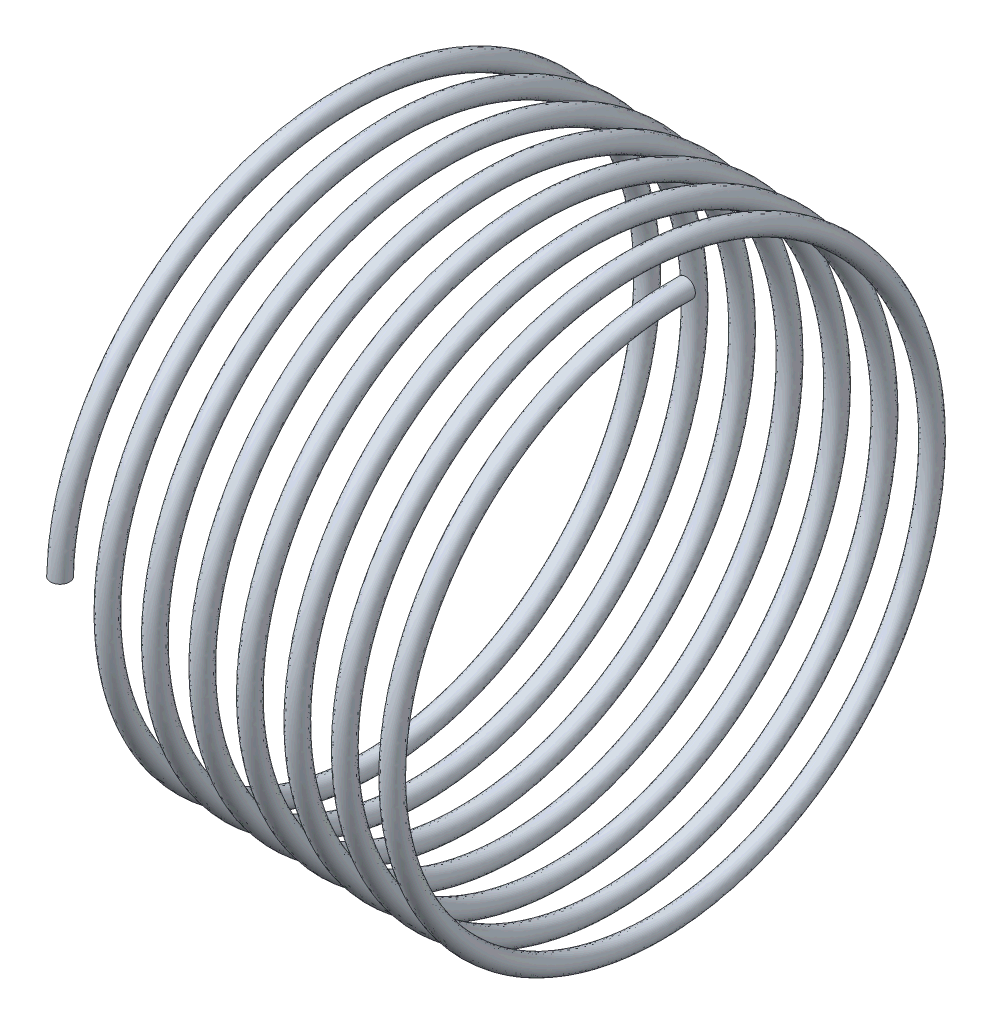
ISO-10303-21;
HEADER;
FILE_DESCRIPTION(('STEP AP214'),'2;1');
FILE_NAME('part.step','',(''),(''),'','','');
FILE_SCHEMA(('AUTOMOTIVE_DESIGN { 1 0 10303 214 1 1 1 1 }'));
ENDSEC;
DATA;
#1=APPLICATION_CONTEXT('core data for automotive mechanical design processes');
#2=APPLICATION_PROTOCOL_DEFINITION('international standard','automotive_design',2000,#1);
#3=PRODUCT_CONTEXT('',#1,'mechanical');
#4=PRODUCT('Part','Part','',(#3));
#5=PRODUCT_RELATED_PRODUCT_CATEGORY('part','',(#4));
#6=PRODUCT_DEFINITION_FORMATION('','',#4);
#7=PRODUCT_DEFINITION_CONTEXT('part definition',#1,'design');
#8=PRODUCT_DEFINITION('design','',#6,#7);
#9=PRODUCT_DEFINITION_SHAPE('','',#8);
#10=(LENGTH_UNIT() NAMED_UNIT(*) SI_UNIT(.MILLI.,.METRE.));
#11=(NAMED_UNIT(*) PLANE_ANGLE_UNIT() SI_UNIT($,.RADIAN.));
#12=(NAMED_UNIT(*) SI_UNIT($,.STERADIAN.) SOLID_ANGLE_UNIT());
#13=UNCERTAINTY_MEASURE_WITH_UNIT(LENGTH_MEASURE(1.E-05),#10,'distance_accuracy_value','');
#14=(GEOMETRIC_REPRESENTATION_CONTEXT(3) GLOBAL_UNCERTAINTY_ASSIGNED_CONTEXT((#13)) GLOBAL_UNIT_ASSIGNED_CONTEXT((#10,
#11,#12)) REPRESENTATION_CONTEXT('',''));
#15=CARTESIAN_POINT('',(0.,0.,0.));
#16=DIRECTION('',(0.,0.,1.));
#17=DIRECTION('',(1.,0.,0.));
#18=AXIS2_PLACEMENT_3D('',#15,#16,#17);
#19=CARTESIAN_POINT('',(-2.31866256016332E-08,5.49904761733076E-10,28.6512));
#20=DIRECTION('',(0.,-1.,1.9193079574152E-11));
#21=DIRECTION('',(0.,-1.9193079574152E-11,-1.));
#22=AXIS2_PLACEMENT_3D('',#19,#20,#21);
#23=PLANE('',#22);
#24=CARTESIAN_POINT('',(-2.31866257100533E-08,5.69097841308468E-10,29.6512));
#25=DIRECTION('',(0.,1.,-1.9193079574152E-11));
#26=DIRECTION('',(0.,1.91930795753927E-11,1.));
#27=AXIS2_PLACEMENT_3D('',#24,#25,#26);
#28=CIRCLE('',#27,1.);
#29=CARTESIAN_POINT('',(-2.31866258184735E-08,5.88290920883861E-10,30.6512));
#30=VERTEX_POINT('',#29);
#31=EDGE_CURVE('E50',#30,#30,#28,.T.);
#32=ORIENTED_EDGE('',*,*,#31,.F.);
#33=EDGE_LOOP('',(#32));
#34=FACE_BOUND('',#33,.T.);
#35=ADVANCED_FACE('F43',(#34),#23,.T.);
#36=CARTESIAN_POINT('',(36.2499989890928,28.6511999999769,3.6396865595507E-05));
#37=DIRECTION('',(0.,-1.2703434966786E-06,0.999999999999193));
#38=DIRECTION('',(0.,-0.999999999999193,-1.2703434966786E-06));
#39=AXIS2_PLACEMENT_3D('',#36,#37,#38);
#40=PLANE('',#39);
#41=CARTESIAN_POINT('',(36.2499989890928,29.6511999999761,3.76672090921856E-05));
#42=DIRECTION('',(0.,-1.2703434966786E-06,0.999999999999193));
#43=DIRECTION('',(0.,0.999999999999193,1.27034349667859E-06));
#44=AXIS2_PLACEMENT_3D('',#41,#42,#43);
#45=CIRCLE('',#44,0.999999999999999);
#46=CARTESIAN_POINT('',(36.2499989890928,30.6511999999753,3.89375525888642E-05));
#47=VERTEX_POINT('',#46);
#48=EDGE_CURVE('E10',#47,#47,#45,.T.);
#49=ORIENTED_EDGE('',*,*,#48,.F.);
#50=EDGE_LOOP('',(#49));
#51=FACE_BOUND('',#50,.T.);
#52=ADVANCED_FACE('F44',(#51),#40,.F.);
#53=CARTESIAN_POINT('',(-2.31866258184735E-08,5.88290920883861E-10,30.6512));
#54=CARTESIAN_POINT('',(0.208332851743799,8.21294342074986,30.6511999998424));
#55=CARTESIAN_POINT('',(0.416665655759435,15.3255662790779,26.5447373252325));
#56=CARTESIAN_POINT('',(0.624998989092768,22.4382072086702,22.4382642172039));
#57=CARTESIAN_POINT('',(0.833332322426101,26.5446983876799,15.3256337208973));
#58=CARTESIAN_POINT('',(1.04166565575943,30.6511895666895,8.21300322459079));
#59=CARTESIAN_POINT('',(1.24999898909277,30.6511999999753,3.89375525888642E-05));
#60=CARTESIAN_POINT('',(1.4583323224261,30.651210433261,-8.2129253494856));
#61=CARTESIAN_POINT('',(1.66666565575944,26.5447373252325,-15.3255662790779));
#62=CARTESIAN_POINT('',(1.87499898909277,22.4382642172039,-22.4382072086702));
#63=CARTESIAN_POINT('',(2.0833323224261,15.3256337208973,-26.5446983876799));
#64=CARTESIAN_POINT('',(2.29166565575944,8.21300322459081,-30.6511895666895));
#65=CARTESIAN_POINT('',(2.49999898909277,3.89375525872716E-05,-30.6511999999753));
#66=CARTESIAN_POINT('',(2.7083323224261,-8.2129253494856,-30.651210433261));
#67=CARTESIAN_POINT('',(2.91666565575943,-15.3255662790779,-26.5447373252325));
#68=CARTESIAN_POINT('',(3.12499898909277,-22.4382072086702,-22.4382642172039));
#69=CARTESIAN_POINT('',(3.3333323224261,-26.5446983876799,-15.3256337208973));
#70=CARTESIAN_POINT('',(3.54166565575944,-30.6511895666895,-8.2130032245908));
#71=CARTESIAN_POINT('',(3.74999898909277,-30.6511999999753,-3.89375525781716E-05));
#72=CARTESIAN_POINT('',(3.9583323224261,-30.651210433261,8.21292534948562));
#73=CARTESIAN_POINT('',(4.16666565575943,-26.5447373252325,15.3255662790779));
#74=CARTESIAN_POINT('',(4.37499898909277,-22.4382642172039,22.4382072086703));
#75=CARTESIAN_POINT('',(4.5833323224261,-15.3256337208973,26.5446983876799));
#76=CARTESIAN_POINT('',(4.79166565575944,-8.21300322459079,30.6511895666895));
#77=CARTESIAN_POINT('',(4.99999898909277,-3.89375525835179E-05,30.6511999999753));
#78=CARTESIAN_POINT('',(5.2083323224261,8.21292534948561,30.651210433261));
#79=CARTESIAN_POINT('',(5.41666565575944,15.3255662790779,26.5447373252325));
#80=CARTESIAN_POINT('',(5.62499898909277,22.4382072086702,22.4382642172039));
#81=CARTESIAN_POINT('',(5.8333323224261,26.5446983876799,15.3256337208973));
#82=CARTESIAN_POINT('',(6.04166565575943,30.6511895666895,8.21300322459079));
#83=CARTESIAN_POINT('',(6.24999898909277,30.6511999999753,3.89375525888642E-05));
#84=CARTESIAN_POINT('',(6.4583323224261,30.651210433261,-8.2129253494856));
#85=CARTESIAN_POINT('',(6.66666565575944,26.5447373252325,-15.3255662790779));
#86=CARTESIAN_POINT('',(6.87499898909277,22.4382642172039,-22.4382072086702));
#87=CARTESIAN_POINT('',(7.0833323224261,15.3256337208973,-26.5446983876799));
#88=CARTESIAN_POINT('',(7.29166565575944,8.21300322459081,-30.6511895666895));
#89=CARTESIAN_POINT('',(7.49999898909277,3.89375525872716E-05,-30.6511999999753));
#90=CARTESIAN_POINT('',(7.7083323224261,-8.2129253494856,-30.651210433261));
#91=CARTESIAN_POINT('',(7.91666565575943,-15.3255662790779,-26.5447373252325));
#92=CARTESIAN_POINT('',(8.12499898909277,-22.4382072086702,-22.4382642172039));
#93=CARTESIAN_POINT('',(8.3333323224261,-26.5446983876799,-15.3256337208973));
#94=CARTESIAN_POINT('',(8.54166565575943,-30.6511895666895,-8.2130032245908));
#95=CARTESIAN_POINT('',(8.74999898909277,-30.6511999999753,-3.89375525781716E-05));
#96=CARTESIAN_POINT('',(8.9583323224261,-30.651210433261,8.21292534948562));
#97=CARTESIAN_POINT('',(9.16666565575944,-26.5447373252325,15.3255662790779));
#98=CARTESIAN_POINT('',(9.37499898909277,-22.4382642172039,22.4382072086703));
#99=CARTESIAN_POINT('',(9.5833323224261,-15.3256337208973,26.5446983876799));
#100=CARTESIAN_POINT('',(9.79166565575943,-8.21300322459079,30.6511895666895));
#101=CARTESIAN_POINT('',(9.99999898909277,-3.89375525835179E-05,30.6511999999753));
#102=CARTESIAN_POINT('',(10.2083323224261,8.21292534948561,30.651210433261));
#103=CARTESIAN_POINT('',(10.4166656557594,15.3255662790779,26.5447373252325));
#104=CARTESIAN_POINT('',(10.6249989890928,22.4382072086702,22.4382642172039));
#105=CARTESIAN_POINT('',(10.8333323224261,26.5446983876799,15.3256337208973));
#106=CARTESIAN_POINT('',(11.0416656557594,30.6511895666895,8.21300322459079));
#107=CARTESIAN_POINT('',(11.2499989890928,30.6511999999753,3.89375525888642E-05));
#108=CARTESIAN_POINT('',(11.4583323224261,30.651210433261,-8.2129253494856));
#109=CARTESIAN_POINT('',(11.6666656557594,26.5447373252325,-15.3255662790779));
#110=CARTESIAN_POINT('',(11.8749989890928,22.4382642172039,-22.4382072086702));
#111=CARTESIAN_POINT('',(12.0833323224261,15.3256337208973,-26.5446983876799));
#112=CARTESIAN_POINT('',(12.2916656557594,8.21300322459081,-30.6511895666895));
#113=CARTESIAN_POINT('',(12.4999989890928,3.89375525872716E-05,-30.6511999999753));
#114=CARTESIAN_POINT('',(12.7083323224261,-8.2129253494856,-30.651210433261));
#115=CARTESIAN_POINT('',(12.9166656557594,-15.3255662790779,-26.5447373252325));
#116=CARTESIAN_POINT('',(13.1249989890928,-22.4382072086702,-22.4382642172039));
#117=CARTESIAN_POINT('',(13.3333323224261,-26.5446983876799,-15.3256337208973));
#118=CARTESIAN_POINT('',(13.5416656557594,-30.6511895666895,-8.2130032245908));
#119=CARTESIAN_POINT('',(13.7499989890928,-30.6511999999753,-3.89375525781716E-05));
#120=CARTESIAN_POINT('',(13.9583323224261,-30.651210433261,8.21292534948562));
#121=CARTESIAN_POINT('',(14.1666656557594,-26.5447373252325,15.3255662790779));
#122=CARTESIAN_POINT('',(14.3749989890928,-22.4382642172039,22.4382072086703));
#123=CARTESIAN_POINT('',(14.5833323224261,-15.3256337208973,26.5446983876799));
#124=CARTESIAN_POINT('',(14.7916656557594,-8.21300322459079,30.6511895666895));
#125=CARTESIAN_POINT('',(14.9999989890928,-3.89375525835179E-05,30.6511999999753));
#126=CARTESIAN_POINT('',(15.2083323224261,8.21292534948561,30.651210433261));
#127=CARTESIAN_POINT('',(15.4166656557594,15.3255662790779,26.5447373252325));
#128=CARTESIAN_POINT('',(15.6249989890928,22.4382072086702,22.4382642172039));
#129=CARTESIAN_POINT('',(15.8333323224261,26.5446983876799,15.3256337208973));
#130=CARTESIAN_POINT('',(16.0416656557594,30.6511895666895,8.21300322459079));
#131=CARTESIAN_POINT('',(16.2499989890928,30.6511999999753,3.89375525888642E-05));
#132=CARTESIAN_POINT('',(16.4583323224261,30.651210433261,-8.2129253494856));
#133=CARTESIAN_POINT('',(16.6666656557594,26.5447373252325,-15.3255662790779));
#134=CARTESIAN_POINT('',(16.8749989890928,22.4382642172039,-22.4382072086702));
#135=CARTESIAN_POINT('',(17.0833323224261,15.3256337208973,-26.5446983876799));
#136=CARTESIAN_POINT('',(17.2916656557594,8.21300322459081,-30.6511895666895));
#137=CARTESIAN_POINT('',(17.4999989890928,3.89375525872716E-05,-30.6511999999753));
#138=CARTESIAN_POINT('',(17.7083323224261,-8.2129253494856,-30.651210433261));
#139=CARTESIAN_POINT('',(17.9166656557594,-15.3255662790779,-26.5447373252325));
#140=CARTESIAN_POINT('',(18.1249989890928,-22.4382072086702,-22.4382642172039));
#141=CARTESIAN_POINT('',(18.3333323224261,-26.5446983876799,-15.3256337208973));
#142=CARTESIAN_POINT('',(18.5416656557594,-30.6511895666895,-8.2130032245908));
#143=CARTESIAN_POINT('',(18.7499989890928,-30.6511999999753,-3.89375525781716E-05));
#144=CARTESIAN_POINT('',(18.9583323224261,-30.651210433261,8.21292534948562));
#145=CARTESIAN_POINT('',(19.1666656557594,-26.5447373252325,15.3255662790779));
#146=CARTESIAN_POINT('',(19.3749989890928,-22.4382642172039,22.4382072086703));
#147=CARTESIAN_POINT('',(19.5833323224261,-15.3256337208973,26.5446983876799));
#148=CARTESIAN_POINT('',(19.7916656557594,-8.21300322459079,30.6511895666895));
#149=CARTESIAN_POINT('',(19.9999989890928,-3.89375525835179E-05,30.6511999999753));
#150=CARTESIAN_POINT('',(20.2083323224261,8.21292534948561,30.651210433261));
#151=CARTESIAN_POINT('',(20.4166656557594,15.3255662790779,26.5447373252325));
#152=CARTESIAN_POINT('',(20.6249989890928,22.4382072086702,22.4382642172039));
#153=CARTESIAN_POINT('',(20.8333323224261,26.5446983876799,15.3256337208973));
#154=CARTESIAN_POINT('',(21.0416656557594,30.6511895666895,8.21300322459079));
#155=CARTESIAN_POINT('',(21.2499989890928,30.6511999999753,3.89375525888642E-05));
#156=CARTESIAN_POINT('',(21.4583323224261,30.651210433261,-8.2129253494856));
#157=CARTESIAN_POINT('',(21.6666656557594,26.5447373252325,-15.3255662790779));
#158=CARTESIAN_POINT('',(21.8749989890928,22.4382642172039,-22.4382072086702));
#159=CARTESIAN_POINT('',(22.0833323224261,15.3256337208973,-26.5446983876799));
#160=CARTESIAN_POINT('',(22.2916656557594,8.21300322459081,-30.6511895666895));
#161=CARTESIAN_POINT('',(22.4999989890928,3.89375525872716E-05,-30.6511999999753));
#162=CARTESIAN_POINT('',(22.7083323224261,-8.2129253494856,-30.651210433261));
#163=CARTESIAN_POINT('',(22.9166656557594,-15.3255662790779,-26.5447373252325));
#164=CARTESIAN_POINT('',(23.1249989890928,-22.4382072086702,-22.4382642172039));
#165=CARTESIAN_POINT('',(23.3333323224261,-26.5446983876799,-15.3256337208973));
#166=CARTESIAN_POINT('',(23.5416656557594,-30.6511895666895,-8.2130032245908));
#167=CARTESIAN_POINT('',(23.7499989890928,-30.6511999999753,-3.89375525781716E-05));
#168=CARTESIAN_POINT('',(23.9583323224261,-30.651210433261,8.21292534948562));
#169=CARTESIAN_POINT('',(24.1666656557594,-26.5447373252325,15.3255662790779));
#170=CARTESIAN_POINT('',(24.3749989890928,-22.4382642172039,22.4382072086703));
#171=CARTESIAN_POINT('',(24.5833323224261,-15.3256337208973,26.5446983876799));
#172=CARTESIAN_POINT('',(24.7916656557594,-8.21300322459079,30.6511895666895));
#173=CARTESIAN_POINT('',(24.9999989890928,-3.89375525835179E-05,30.6511999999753));
#174=CARTESIAN_POINT('',(25.2083323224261,8.21292534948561,30.651210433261));
#175=CARTESIAN_POINT('',(25.4166656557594,15.3255662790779,26.5447373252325));
#176=CARTESIAN_POINT('',(25.6249989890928,22.4382072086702,22.4382642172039));
#177=CARTESIAN_POINT('',(25.8333323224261,26.5446983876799,15.3256337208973));
#178=CARTESIAN_POINT('',(26.0416656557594,30.6511895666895,8.21300322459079));
#179=CARTESIAN_POINT('',(26.2499989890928,30.6511999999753,3.89375525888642E-05));
#180=CARTESIAN_POINT('',(26.4583323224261,30.651210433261,-8.2129253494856));
#181=CARTESIAN_POINT('',(26.6666656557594,26.5447373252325,-15.3255662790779));
#182=CARTESIAN_POINT('',(26.8749989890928,22.4382642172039,-22.4382072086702));
#183=CARTESIAN_POINT('',(27.0833323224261,15.3256337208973,-26.5446983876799));
#184=CARTESIAN_POINT('',(27.2916656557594,8.21300322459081,-30.6511895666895));
#185=CARTESIAN_POINT('',(27.4999989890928,3.89375525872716E-05,-30.6511999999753));
#186=CARTESIAN_POINT('',(27.7083323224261,-8.2129253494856,-30.651210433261));
#187=CARTESIAN_POINT('',(27.9166656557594,-15.3255662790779,-26.5447373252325));
#188=CARTESIAN_POINT('',(28.1249989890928,-22.4382072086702,-22.4382642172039));
#189=CARTESIAN_POINT('',(28.3333323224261,-26.5446983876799,-15.3256337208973));
#190=CARTESIAN_POINT('',(28.5416656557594,-30.6511895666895,-8.2130032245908));
#191=CARTESIAN_POINT('',(28.7499989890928,-30.6511999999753,-3.89375525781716E-05));
#192=CARTESIAN_POINT('',(28.9583323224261,-30.651210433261,8.21292534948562));
#193=CARTESIAN_POINT('',(29.1666656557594,-26.5447373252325,15.3255662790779));
#194=CARTESIAN_POINT('',(29.3749989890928,-22.4382642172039,22.4382072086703));
#195=CARTESIAN_POINT('',(29.5833323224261,-15.3256337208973,26.5446983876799));
#196=CARTESIAN_POINT('',(29.7916656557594,-8.21300322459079,30.6511895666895));
#197=CARTESIAN_POINT('',(29.9999989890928,-3.89375525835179E-05,30.6511999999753));
#198=CARTESIAN_POINT('',(30.2083323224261,8.21292534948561,30.651210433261));
#199=CARTESIAN_POINT('',(30.4166656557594,15.3255662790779,26.5447373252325));
#200=CARTESIAN_POINT('',(30.6249989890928,22.4382072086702,22.4382642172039));
#201=CARTESIAN_POINT('',(30.8333323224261,26.5446983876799,15.3256337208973));
#202=CARTESIAN_POINT('',(31.0416656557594,30.6511895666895,8.21300322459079));
#203=CARTESIAN_POINT('',(31.2499989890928,30.6511999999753,3.89375525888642E-05));
#204=CARTESIAN_POINT('',(31.4583323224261,30.651210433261,-8.2129253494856));
#205=CARTESIAN_POINT('',(31.6666656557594,26.5447373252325,-15.3255662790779));
#206=CARTESIAN_POINT('',(31.8749989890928,22.4382642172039,-22.4382072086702));
#207=CARTESIAN_POINT('',(32.0833323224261,15.3256337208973,-26.5446983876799));
#208=CARTESIAN_POINT('',(32.2916656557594,8.21300322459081,-30.6511895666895));
#209=CARTESIAN_POINT('',(32.4999989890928,3.89375525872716E-05,-30.6511999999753));
#210=CARTESIAN_POINT('',(32.7083323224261,-8.2129253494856,-30.651210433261));
#211=CARTESIAN_POINT('',(32.9166656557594,-15.3255662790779,-26.5447373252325));
#212=CARTESIAN_POINT('',(33.1249989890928,-22.4382072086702,-22.4382642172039));
#213=CARTESIAN_POINT('',(33.3333323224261,-26.5446983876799,-15.3256337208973));
#214=CARTESIAN_POINT('',(33.5416656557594,-30.6511895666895,-8.2130032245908));
#215=CARTESIAN_POINT('',(33.7499989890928,-30.6511999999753,-3.89375525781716E-05));
#216=CARTESIAN_POINT('',(33.9583323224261,-30.651210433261,8.21292534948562));
#217=CARTESIAN_POINT('',(34.1666656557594,-26.5447373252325,15.3255662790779));
#218=CARTESIAN_POINT('',(34.3749989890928,-22.4382642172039,22.4382072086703));
#219=CARTESIAN_POINT('',(34.5833323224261,-15.3256337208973,26.5446983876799));
#220=CARTESIAN_POINT('',(34.7916656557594,-8.21300322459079,30.6511895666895));
#221=CARTESIAN_POINT('',(34.9999989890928,-3.89375525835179E-05,30.6511999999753));
#222=CARTESIAN_POINT('',(35.2083323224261,8.21292534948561,30.651210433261));
#223=CARTESIAN_POINT('',(35.4166656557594,15.3255662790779,26.5447373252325));
#224=CARTESIAN_POINT('',(35.6249989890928,22.4382072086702,22.4382642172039));
#225=CARTESIAN_POINT('',(35.8333323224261,26.5446983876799,15.3256337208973));
#226=CARTESIAN_POINT('',(36.0416656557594,30.6511895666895,8.21300322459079));
#227=CARTESIAN_POINT('',(36.2499989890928,30.6511999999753,3.89375525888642E-05));
#228=CARTESIAN_POINT('',(1.99999997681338,5.88290920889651E-10,30.6512));
#229=CARTESIAN_POINT('',(2.2083328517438,8.21294342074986,30.6511999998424));
#230=CARTESIAN_POINT('',(2.41666565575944,15.3255662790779,26.5447373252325));
#231=CARTESIAN_POINT('',(2.62499898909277,22.4382072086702,22.4382642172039));
#232=CARTESIAN_POINT('',(2.8333323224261,26.5446983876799,15.3256337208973));
#233=CARTESIAN_POINT('',(3.04166565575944,30.6511895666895,8.21300322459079));
#234=CARTESIAN_POINT('',(3.24999898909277,30.6511999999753,3.89375525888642E-05));
#235=CARTESIAN_POINT('',(3.4583323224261,30.651210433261,-8.2129253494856));
#236=CARTESIAN_POINT('',(3.66666565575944,26.5447373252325,-15.3255662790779));
#237=CARTESIAN_POINT('',(3.87499898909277,22.4382642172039,-22.4382072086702));
#238=CARTESIAN_POINT('',(4.0833323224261,15.3256337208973,-26.5446983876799));
#239=CARTESIAN_POINT('',(4.29166565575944,8.21300322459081,-30.6511895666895));
#240=CARTESIAN_POINT('',(4.49999898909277,3.89375525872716E-05,-30.6511999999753));
#241=CARTESIAN_POINT('',(4.7083323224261,-8.21292534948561,-30.651210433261));
#242=CARTESIAN_POINT('',(4.91666565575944,-15.3255662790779,-26.5447373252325));
#243=CARTESIAN_POINT('',(5.12499898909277,-22.4382072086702,-22.4382642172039));
#244=CARTESIAN_POINT('',(5.3333323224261,-26.5446983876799,-15.3256337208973));
#245=CARTESIAN_POINT('',(5.54166565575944,-30.6511895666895,-8.2130032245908));
#246=CARTESIAN_POINT('',(5.74999898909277,-30.6511999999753,-3.89375525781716E-05));
#247=CARTESIAN_POINT('',(5.9583323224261,-30.651210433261,8.21292534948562));
#248=CARTESIAN_POINT('',(6.16666565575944,-26.5447373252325,15.3255662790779));
#249=CARTESIAN_POINT('',(6.37499898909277,-22.4382642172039,22.4382072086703));
#250=CARTESIAN_POINT('',(6.5833323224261,-15.3256337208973,26.5446983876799));
#251=CARTESIAN_POINT('',(6.79166565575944,-8.21300322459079,30.6511895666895));
#252=CARTESIAN_POINT('',(6.99999898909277,-3.89375525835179E-05,30.6511999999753));
#253=CARTESIAN_POINT('',(7.20833232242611,8.21292534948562,30.651210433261));
#254=CARTESIAN_POINT('',(7.41666565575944,15.3255662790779,26.5447373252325));
#255=CARTESIAN_POINT('',(7.62499898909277,22.4382072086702,22.4382642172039));
#256=CARTESIAN_POINT('',(7.8333323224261,26.5446983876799,15.3256337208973));
#257=CARTESIAN_POINT('',(8.04166565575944,30.6511895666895,8.21300322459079));
#258=CARTESIAN_POINT('',(8.24999898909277,30.6511999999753,3.89375525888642E-05));
#259=CARTESIAN_POINT('',(8.45833232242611,30.651210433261,-8.2129253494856));
#260=CARTESIAN_POINT('',(8.66666565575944,26.5447373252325,-15.3255662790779));
#261=CARTESIAN_POINT('',(8.87499898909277,22.4382642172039,-22.4382072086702));
#262=CARTESIAN_POINT('',(9.0833323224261,15.3256337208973,-26.5446983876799));
#263=CARTESIAN_POINT('',(9.29166565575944,8.21300322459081,-30.6511895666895));
#264=CARTESIAN_POINT('',(9.49999898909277,3.89375525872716E-05,-30.6511999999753));
#265=CARTESIAN_POINT('',(9.70833232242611,-8.21292534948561,-30.651210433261));
#266=CARTESIAN_POINT('',(9.91666565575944,-15.3255662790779,-26.5447373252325));
#267=CARTESIAN_POINT('',(10.1249989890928,-22.4382072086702,-22.4382642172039));
#268=CARTESIAN_POINT('',(10.3333323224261,-26.5446983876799,-15.3256337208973));
#269=CARTESIAN_POINT('',(10.5416656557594,-30.6511895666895,-8.2130032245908));
#270=CARTESIAN_POINT('',(10.7499989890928,-30.6511999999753,-3.89375525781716E-05));
#271=CARTESIAN_POINT('',(10.9583323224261,-30.651210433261,8.21292534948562));
#272=CARTESIAN_POINT('',(11.1666656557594,-26.5447373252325,15.3255662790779));
#273=CARTESIAN_POINT('',(11.3749989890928,-22.4382642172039,22.4382072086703));
#274=CARTESIAN_POINT('',(11.5833323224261,-15.3256337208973,26.5446983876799));
#275=CARTESIAN_POINT('',(11.7916656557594,-8.21300322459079,30.6511895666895));
#276=CARTESIAN_POINT('',(11.9999989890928,-3.89375525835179E-05,30.6511999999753));
#277=CARTESIAN_POINT('',(12.2083323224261,8.21292534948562,30.651210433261));
#278=CARTESIAN_POINT('',(12.4166656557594,15.3255662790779,26.5447373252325));
#279=CARTESIAN_POINT('',(12.6249989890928,22.4382072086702,22.4382642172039));
#280=CARTESIAN_POINT('',(12.8333323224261,26.5446983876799,15.3256337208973));
#281=CARTESIAN_POINT('',(13.0416656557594,30.6511895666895,8.21300322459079));
#282=CARTESIAN_POINT('',(13.2499989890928,30.6511999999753,3.89375525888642E-05));
#283=CARTESIAN_POINT('',(13.4583323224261,30.651210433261,-8.2129253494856));
#284=CARTESIAN_POINT('',(13.6666656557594,26.5447373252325,-15.3255662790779));
#285=CARTESIAN_POINT('',(13.8749989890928,22.4382642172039,-22.4382072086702));
#286=CARTESIAN_POINT('',(14.0833323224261,15.3256337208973,-26.5446983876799));
#287=CARTESIAN_POINT('',(14.2916656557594,8.21300322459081,-30.6511895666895));
#288=CARTESIAN_POINT('',(14.4999989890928,3.89375525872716E-05,-30.6511999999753));
#289=CARTESIAN_POINT('',(14.7083323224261,-8.21292534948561,-30.651210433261));
#290=CARTESIAN_POINT('',(14.9166656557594,-15.3255662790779,-26.5447373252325));
#291=CARTESIAN_POINT('',(15.1249989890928,-22.4382072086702,-22.4382642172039));
#292=CARTESIAN_POINT('',(15.3333323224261,-26.5446983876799,-15.3256337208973));
#293=CARTESIAN_POINT('',(15.5416656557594,-30.6511895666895,-8.2130032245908));
#294=CARTESIAN_POINT('',(15.7499989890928,-30.6511999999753,-3.89375525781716E-05));
#295=CARTESIAN_POINT('',(15.9583323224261,-30.651210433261,8.21292534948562));
#296=CARTESIAN_POINT('',(16.1666656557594,-26.5447373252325,15.3255662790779));
#297=CARTESIAN_POINT('',(16.3749989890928,-22.4382642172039,22.4382072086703));
#298=CARTESIAN_POINT('',(16.5833323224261,-15.3256337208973,26.5446983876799));
#299=CARTESIAN_POINT('',(16.7916656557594,-8.21300322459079,30.6511895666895));
#300=CARTESIAN_POINT('',(16.9999989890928,-3.89375525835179E-05,30.6511999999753));
#301=CARTESIAN_POINT('',(17.2083323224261,8.21292534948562,30.651210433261));
#302=CARTESIAN_POINT('',(17.4166656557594,15.3255662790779,26.5447373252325));
#303=CARTESIAN_POINT('',(17.6249989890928,22.4382072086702,22.4382642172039));
#304=CARTESIAN_POINT('',(17.8333323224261,26.5446983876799,15.3256337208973));
#305=CARTESIAN_POINT('',(18.0416656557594,30.6511895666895,8.21300322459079));
#306=CARTESIAN_POINT('',(18.2499989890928,30.6511999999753,3.89375525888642E-05));
#307=CARTESIAN_POINT('',(18.4583323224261,30.651210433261,-8.2129253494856));
#308=CARTESIAN_POINT('',(18.6666656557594,26.5447373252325,-15.3255662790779));
#309=CARTESIAN_POINT('',(18.8749989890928,22.4382642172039,-22.4382072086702));
#310=CARTESIAN_POINT('',(19.0833323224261,15.3256337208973,-26.5446983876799));
#311=CARTESIAN_POINT('',(19.2916656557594,8.21300322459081,-30.6511895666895));
#312=CARTESIAN_POINT('',(19.4999989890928,3.89375525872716E-05,-30.6511999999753));
#313=CARTESIAN_POINT('',(19.7083323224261,-8.21292534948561,-30.651210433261));
#314=CARTESIAN_POINT('',(19.9166656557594,-15.3255662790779,-26.5447373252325));
#315=CARTESIAN_POINT('',(20.1249989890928,-22.4382072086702,-22.4382642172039));
#316=CARTESIAN_POINT('',(20.3333323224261,-26.5446983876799,-15.3256337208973));
#317=CARTESIAN_POINT('',(20.5416656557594,-30.6511895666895,-8.2130032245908));
#318=CARTESIAN_POINT('',(20.7499989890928,-30.6511999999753,-3.89375525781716E-05));
#319=CARTESIAN_POINT('',(20.9583323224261,-30.651210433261,8.21292534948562));
#320=CARTESIAN_POINT('',(21.1666656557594,-26.5447373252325,15.3255662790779));
#321=CARTESIAN_POINT('',(21.3749989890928,-22.4382642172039,22.4382072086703));
#322=CARTESIAN_POINT('',(21.5833323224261,-15.3256337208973,26.5446983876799));
#323=CARTESIAN_POINT('',(21.7916656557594,-8.21300322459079,30.6511895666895));
#324=CARTESIAN_POINT('',(21.9999989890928,-3.89375525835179E-05,30.6511999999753));
#325=CARTESIAN_POINT('',(22.2083323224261,8.21292534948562,30.651210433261));
#326=CARTESIAN_POINT('',(22.4166656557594,15.3255662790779,26.5447373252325));
#327=CARTESIAN_POINT('',(22.6249989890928,22.4382072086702,22.4382642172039));
#328=CARTESIAN_POINT('',(22.8333323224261,26.5446983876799,15.3256337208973));
#329=CARTESIAN_POINT('',(23.0416656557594,30.6511895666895,8.21300322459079));
#330=CARTESIAN_POINT('',(23.2499989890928,30.6511999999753,3.89375525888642E-05));
#331=CARTESIAN_POINT('',(23.4583323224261,30.651210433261,-8.2129253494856));
#332=CARTESIAN_POINT('',(23.6666656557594,26.5447373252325,-15.3255662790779));
#333=CARTESIAN_POINT('',(23.8749989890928,22.4382642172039,-22.4382072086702));
#334=CARTESIAN_POINT('',(24.0833323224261,15.3256337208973,-26.5446983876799));
#335=CARTESIAN_POINT('',(24.2916656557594,8.21300322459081,-30.6511895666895));
#336=CARTESIAN_POINT('',(24.4999989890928,3.89375525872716E-05,-30.6511999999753));
#337=CARTESIAN_POINT('',(24.7083323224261,-8.21292534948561,-30.651210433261));
#338=CARTESIAN_POINT('',(24.9166656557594,-15.3255662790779,-26.5447373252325));
#339=CARTESIAN_POINT('',(25.1249989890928,-22.4382072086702,-22.4382642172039));
#340=CARTESIAN_POINT('',(25.3333323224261,-26.5446983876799,-15.3256337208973));
#341=CARTESIAN_POINT('',(25.5416656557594,-30.6511895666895,-8.2130032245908));
#342=CARTESIAN_POINT('',(25.7499989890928,-30.6511999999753,-3.89375525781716E-05));
#343=CARTESIAN_POINT('',(25.9583323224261,-30.651210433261,8.21292534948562));
#344=CARTESIAN_POINT('',(26.1666656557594,-26.5447373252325,15.3255662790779));
#345=CARTESIAN_POINT('',(26.3749989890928,-22.4382642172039,22.4382072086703));
#346=CARTESIAN_POINT('',(26.5833323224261,-15.3256337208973,26.5446983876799));
#347=CARTESIAN_POINT('',(26.7916656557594,-8.21300322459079,30.6511895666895));
#348=CARTESIAN_POINT('',(26.9999989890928,-3.89375525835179E-05,30.6511999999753));
#349=CARTESIAN_POINT('',(27.2083323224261,8.21292534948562,30.651210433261));
#350=CARTESIAN_POINT('',(27.4166656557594,15.3255662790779,26.5447373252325));
#351=CARTESIAN_POINT('',(27.6249989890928,22.4382072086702,22.4382642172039));
#352=CARTESIAN_POINT('',(27.8333323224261,26.5446983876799,15.3256337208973));
#353=CARTESIAN_POINT('',(28.0416656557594,30.6511895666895,8.21300322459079));
#354=CARTESIAN_POINT('',(28.2499989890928,30.6511999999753,3.89375525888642E-05));
#355=CARTESIAN_POINT('',(28.4583323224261,30.651210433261,-8.2129253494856));
#356=CARTESIAN_POINT('',(28.6666656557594,26.5447373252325,-15.3255662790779));
#357=CARTESIAN_POINT('',(28.8749989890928,22.4382642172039,-22.4382072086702));
#358=CARTESIAN_POINT('',(29.0833323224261,15.3256337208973,-26.5446983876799));
#359=CARTESIAN_POINT('',(29.2916656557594,8.21300322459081,-30.6511895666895));
#360=CARTESIAN_POINT('',(29.4999989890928,3.89375525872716E-05,-30.6511999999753));
#361=CARTESIAN_POINT('',(29.7083323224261,-8.21292534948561,-30.651210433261));
#362=CARTESIAN_POINT('',(29.9166656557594,-15.3255662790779,-26.5447373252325));
#363=CARTESIAN_POINT('',(30.1249989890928,-22.4382072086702,-22.4382642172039));
#364=CARTESIAN_POINT('',(30.3333323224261,-26.5446983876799,-15.3256337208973));
#365=CARTESIAN_POINT('',(30.5416656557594,-30.6511895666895,-8.2130032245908));
#366=CARTESIAN_POINT('',(30.7499989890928,-30.6511999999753,-3.89375525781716E-05));
#367=CARTESIAN_POINT('',(30.9583323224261,-30.651210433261,8.21292534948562));
#368=CARTESIAN_POINT('',(31.1666656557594,-26.5447373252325,15.3255662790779));
#369=CARTESIAN_POINT('',(31.3749989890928,-22.4382642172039,22.4382072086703));
#370=CARTESIAN_POINT('',(31.5833323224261,-15.3256337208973,26.5446983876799));
#371=CARTESIAN_POINT('',(31.7916656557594,-8.21300322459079,30.6511895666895));
#372=CARTESIAN_POINT('',(31.9999989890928,-3.89375525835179E-05,30.6511999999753));
#373=CARTESIAN_POINT('',(32.2083323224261,8.21292534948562,30.651210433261));
#374=CARTESIAN_POINT('',(32.4166656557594,15.3255662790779,26.5447373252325));
#375=CARTESIAN_POINT('',(32.6249989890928,22.4382072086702,22.4382642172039));
#376=CARTESIAN_POINT('',(32.8333323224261,26.5446983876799,15.3256337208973));
#377=CARTESIAN_POINT('',(33.0416656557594,30.6511895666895,8.21300322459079));
#378=CARTESIAN_POINT('',(33.2499989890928,30.6511999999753,3.89375525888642E-05));
#379=CARTESIAN_POINT('',(33.4583323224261,30.651210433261,-8.2129253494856));
#380=CARTESIAN_POINT('',(33.6666656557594,26.5447373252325,-15.3255662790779));
#381=CARTESIAN_POINT('',(33.8749989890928,22.4382642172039,-22.4382072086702));
#382=CARTESIAN_POINT('',(34.0833323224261,15.3256337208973,-26.5446983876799));
#383=CARTESIAN_POINT('',(34.2916656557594,8.21300322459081,-30.6511895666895));
#384=CARTESIAN_POINT('',(34.4999989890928,3.89375525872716E-05,-30.6511999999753));
#385=CARTESIAN_POINT('',(34.7083323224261,-8.21292534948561,-30.651210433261));
#386=CARTESIAN_POINT('',(34.9166656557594,-15.3255662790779,-26.5447373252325));
#387=CARTESIAN_POINT('',(35.1249989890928,-22.4382072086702,-22.4382642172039));
#388=CARTESIAN_POINT('',(35.3333323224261,-26.5446983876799,-15.3256337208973));
#389=CARTESIAN_POINT('',(35.5416656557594,-30.6511895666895,-8.2130032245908));
#390=CARTESIAN_POINT('',(35.7499989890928,-30.6511999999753,-3.89375525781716E-05));
#391=CARTESIAN_POINT('',(35.9583323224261,-30.651210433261,8.21292534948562));
#392=CARTESIAN_POINT('',(36.1666656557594,-26.5447373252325,15.3255662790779));
#393=CARTESIAN_POINT('',(36.3749989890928,-22.4382642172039,22.4382072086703));
#394=CARTESIAN_POINT('',(36.5833323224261,-15.3256337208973,26.5446983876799));
#395=CARTESIAN_POINT('',(36.7916656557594,-8.21300322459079,30.6511895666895));
#396=CARTESIAN_POINT('',(36.9999989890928,-3.89375525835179E-05,30.6511999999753));
#397=CARTESIAN_POINT('',(37.2083323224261,8.21292534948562,30.651210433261));
#398=CARTESIAN_POINT('',(37.4166656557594,15.3255662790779,26.5447373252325));
#399=CARTESIAN_POINT('',(37.6249989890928,22.4382072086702,22.4382642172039));
#400=CARTESIAN_POINT('',(37.8333323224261,26.5446983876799,15.3256337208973));
#401=CARTESIAN_POINT('',(38.0416656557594,30.6511895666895,8.21300322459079));
#402=CARTESIAN_POINT('',(38.2499989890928,30.6511999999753,3.89375525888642E-05));
#403=CARTESIAN_POINT('',(1.99999997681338,5.49904761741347E-10,28.6512));
#404=CARTESIAN_POINT('',(2.2083328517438,7.67704639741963,28.6511999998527));
#405=CARTESIAN_POINT('',(2.41666565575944,14.3255684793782,24.8126852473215));
#406=CARTESIAN_POINT('',(2.62499898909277,20.9741074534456,20.9741607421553));
#407=CARTESIAN_POINT('',(2.8333323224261,24.8126488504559,14.3256315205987));
#408=CARTESIAN_POINT('',(3.04166565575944,28.6511902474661,7.67710229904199));
#409=CARTESIAN_POINT('',(3.24999898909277,28.6511999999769,3.6396865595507E-05));
#410=CARTESIAN_POINT('',(3.4583323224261,28.6512097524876,-7.67702950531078));
#411=CARTESIAN_POINT('',(3.66666565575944,24.8126852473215,-14.3255684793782));
#412=CARTESIAN_POINT('',(3.87499898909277,20.9741607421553,-20.9741074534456));
#413=CARTESIAN_POINT('',(4.0833323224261,14.3256315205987,-24.8126488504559));
#414=CARTESIAN_POINT('',(4.29166565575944,7.677102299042,-28.6511902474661));
#415=CARTESIAN_POINT('',(4.49999898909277,3.6396865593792E-05,-28.6511999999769));
#416=CARTESIAN_POINT('',(4.7083323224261,-7.67702950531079,-28.6512097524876));
#417=CARTESIAN_POINT('',(4.91666565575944,-14.3255684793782,-24.8126852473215));
#418=CARTESIAN_POINT('',(5.12499898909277,-20.9741074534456,-20.9741607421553));
#419=CARTESIAN_POINT('',(5.3333323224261,-24.8126488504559,-14.3256315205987));
#420=CARTESIAN_POINT('',(5.54166565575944,-28.6511902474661,-7.677102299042));
#421=CARTESIAN_POINT('',(5.74999898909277,-28.6511999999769,-3.63968655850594E-05));
#422=CARTESIAN_POINT('',(5.9583323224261,-28.6512097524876,7.6770295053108));
#423=CARTESIAN_POINT('',(6.16666565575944,-24.8126852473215,14.3255684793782));
#424=CARTESIAN_POINT('',(6.37499898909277,-20.9741607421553,20.9741074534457));
#425=CARTESIAN_POINT('',(6.5833323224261,-14.3256315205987,24.8126488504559));
#426=CARTESIAN_POINT('',(6.79166565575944,-7.67710229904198,28.6511902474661));
#427=CARTESIAN_POINT('',(6.99999898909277,-3.63968655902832E-05,28.6511999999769));
#428=CARTESIAN_POINT('',(7.20833232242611,7.6770295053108,28.6512097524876));
#429=CARTESIAN_POINT('',(7.41666565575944,14.3255684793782,24.8126852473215));
#430=CARTESIAN_POINT('',(7.62499898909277,20.9741074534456,20.9741607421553));
#431=CARTESIAN_POINT('',(7.8333323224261,24.8126488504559,14.3256315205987));
#432=CARTESIAN_POINT('',(8.04166565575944,28.6511902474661,7.67710229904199));
#433=CARTESIAN_POINT('',(8.24999898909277,28.6511999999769,3.6396865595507E-05));
#434=CARTESIAN_POINT('',(8.45833232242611,28.6512097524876,-7.67702950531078));
#435=CARTESIAN_POINT('',(8.66666565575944,24.8126852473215,-14.3255684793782));
#436=CARTESIAN_POINT('',(8.87499898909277,20.9741607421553,-20.9741074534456));
#437=CARTESIAN_POINT('',(9.0833323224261,14.3256315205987,-24.8126488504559));
#438=CARTESIAN_POINT('',(9.29166565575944,7.677102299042,-28.6511902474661));
#439=CARTESIAN_POINT('',(9.49999898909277,3.6396865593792E-05,-28.6511999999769));
#440=CARTESIAN_POINT('',(9.70833232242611,-7.67702950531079,-28.6512097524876));
#441=CARTESIAN_POINT('',(9.91666565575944,-14.3255684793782,-24.8126852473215));
#442=CARTESIAN_POINT('',(10.1249989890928,-20.9741074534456,-20.9741607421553));
#443=CARTESIAN_POINT('',(10.3333323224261,-24.8126488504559,-14.3256315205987));
#444=CARTESIAN_POINT('',(10.5416656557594,-28.6511902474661,-7.677102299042));
#445=CARTESIAN_POINT('',(10.7499989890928,-28.6511999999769,-3.63968655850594E-05));
#446=CARTESIAN_POINT('',(10.9583323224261,-28.6512097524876,7.6770295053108));
#447=CARTESIAN_POINT('',(11.1666656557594,-24.8126852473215,14.3255684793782));
#448=CARTESIAN_POINT('',(11.3749989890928,-20.9741607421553,20.9741074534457));
#449=CARTESIAN_POINT('',(11.5833323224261,-14.3256315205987,24.8126488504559));
#450=CARTESIAN_POINT('',(11.7916656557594,-7.67710229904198,28.6511902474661));
#451=CARTESIAN_POINT('',(11.9999989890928,-3.63968655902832E-05,28.6511999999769));
#452=CARTESIAN_POINT('',(12.2083323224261,7.6770295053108,28.6512097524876));
#453=CARTESIAN_POINT('',(12.4166656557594,14.3255684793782,24.8126852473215));
#454=CARTESIAN_POINT('',(12.6249989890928,20.9741074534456,20.9741607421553));
#455=CARTESIAN_POINT('',(12.8333323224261,24.8126488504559,14.3256315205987));
#456=CARTESIAN_POINT('',(13.0416656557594,28.6511902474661,7.67710229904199));
#457=CARTESIAN_POINT('',(13.2499989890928,28.6511999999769,3.6396865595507E-05));
#458=CARTESIAN_POINT('',(13.4583323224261,28.6512097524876,-7.67702950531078));
#459=CARTESIAN_POINT('',(13.6666656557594,24.8126852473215,-14.3255684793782));
#460=CARTESIAN_POINT('',(13.8749989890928,20.9741607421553,-20.9741074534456));
#461=CARTESIAN_POINT('',(14.0833323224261,14.3256315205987,-24.8126488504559));
#462=CARTESIAN_POINT('',(14.2916656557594,7.677102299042,-28.6511902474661));
#463=CARTESIAN_POINT('',(14.4999989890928,3.6396865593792E-05,-28.6511999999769));
#464=CARTESIAN_POINT('',(14.7083323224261,-7.67702950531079,-28.6512097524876));
#465=CARTESIAN_POINT('',(14.9166656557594,-14.3255684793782,-24.8126852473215));
#466=CARTESIAN_POINT('',(15.1249989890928,-20.9741074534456,-20.9741607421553));
#467=CARTESIAN_POINT('',(15.3333323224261,-24.8126488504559,-14.3256315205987));
#468=CARTESIAN_POINT('',(15.5416656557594,-28.6511902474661,-7.677102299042));
#469=CARTESIAN_POINT('',(15.7499989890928,-28.6511999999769,-3.63968655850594E-05));
#470=CARTESIAN_POINT('',(15.9583323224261,-28.6512097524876,7.6770295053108));
#471=CARTESIAN_POINT('',(16.1666656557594,-24.8126852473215,14.3255684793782));
#472=CARTESIAN_POINT('',(16.3749989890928,-20.9741607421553,20.9741074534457));
#473=CARTESIAN_POINT('',(16.5833323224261,-14.3256315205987,24.8126488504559));
#474=CARTESIAN_POINT('',(16.7916656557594,-7.67710229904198,28.6511902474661));
#475=CARTESIAN_POINT('',(16.9999989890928,-3.63968655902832E-05,28.6511999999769));
#476=CARTESIAN_POINT('',(17.2083323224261,7.6770295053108,28.6512097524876));
#477=CARTESIAN_POINT('',(17.4166656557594,14.3255684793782,24.8126852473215));
#478=CARTESIAN_POINT('',(17.6249989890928,20.9741074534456,20.9741607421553));
#479=CARTESIAN_POINT('',(17.8333323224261,24.8126488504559,14.3256315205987));
#480=CARTESIAN_POINT('',(18.0416656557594,28.6511902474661,7.67710229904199));
#481=CARTESIAN_POINT('',(18.2499989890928,28.6511999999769,3.6396865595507E-05));
#482=CARTESIAN_POINT('',(18.4583323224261,28.6512097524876,-7.67702950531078));
#483=CARTESIAN_POINT('',(18.6666656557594,24.8126852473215,-14.3255684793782));
#484=CARTESIAN_POINT('',(18.8749989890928,20.9741607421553,-20.9741074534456));
#485=CARTESIAN_POINT('',(19.0833323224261,14.3256315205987,-24.8126488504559));
#486=CARTESIAN_POINT('',(19.2916656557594,7.677102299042,-28.6511902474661));
#487=CARTESIAN_POINT('',(19.4999989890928,3.6396865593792E-05,-28.6511999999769));
#488=CARTESIAN_POINT('',(19.7083323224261,-7.67702950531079,-28.6512097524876));
#489=CARTESIAN_POINT('',(19.9166656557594,-14.3255684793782,-24.8126852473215));
#490=CARTESIAN_POINT('',(20.1249989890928,-20.9741074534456,-20.9741607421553));
#491=CARTESIAN_POINT('',(20.3333323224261,-24.8126488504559,-14.3256315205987));
#492=CARTESIAN_POINT('',(20.5416656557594,-28.6511902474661,-7.677102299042));
#493=CARTESIAN_POINT('',(20.7499989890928,-28.6511999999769,-3.63968655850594E-05));
#494=CARTESIAN_POINT('',(20.9583323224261,-28.6512097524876,7.6770295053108));
#495=CARTESIAN_POINT('',(21.1666656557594,-24.8126852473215,14.3255684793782));
#496=CARTESIAN_POINT('',(21.3749989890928,-20.9741607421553,20.9741074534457));
#497=CARTESIAN_POINT('',(21.5833323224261,-14.3256315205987,24.8126488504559));
#498=CARTESIAN_POINT('',(21.7916656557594,-7.67710229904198,28.6511902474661));
#499=CARTESIAN_POINT('',(21.9999989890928,-3.63968655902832E-05,28.6511999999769));
#500=CARTESIAN_POINT('',(22.2083323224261,7.6770295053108,28.6512097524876));
#501=CARTESIAN_POINT('',(22.4166656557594,14.3255684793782,24.8126852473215));
#502=CARTESIAN_POINT('',(22.6249989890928,20.9741074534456,20.9741607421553));
#503=CARTESIAN_POINT('',(22.8333323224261,24.8126488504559,14.3256315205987));
#504=CARTESIAN_POINT('',(23.0416656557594,28.6511902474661,7.67710229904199));
#505=CARTESIAN_POINT('',(23.2499989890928,28.6511999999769,3.6396865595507E-05));
#506=CARTESIAN_POINT('',(23.4583323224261,28.6512097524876,-7.67702950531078));
#507=CARTESIAN_POINT('',(23.6666656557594,24.8126852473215,-14.3255684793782));
#508=CARTESIAN_POINT('',(23.8749989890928,20.9741607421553,-20.9741074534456));
#509=CARTESIAN_POINT('',(24.0833323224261,14.3256315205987,-24.8126488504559));
#510=CARTESIAN_POINT('',(24.2916656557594,7.677102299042,-28.6511902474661));
#511=CARTESIAN_POINT('',(24.4999989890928,3.6396865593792E-05,-28.6511999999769));
#512=CARTESIAN_POINT('',(24.7083323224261,-7.67702950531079,-28.6512097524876));
#513=CARTESIAN_POINT('',(24.9166656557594,-14.3255684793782,-24.8126852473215));
#514=CARTESIAN_POINT('',(25.1249989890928,-20.9741074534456,-20.9741607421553));
#515=CARTESIAN_POINT('',(25.3333323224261,-24.8126488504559,-14.3256315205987));
#516=CARTESIAN_POINT('',(25.5416656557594,-28.6511902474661,-7.677102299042));
#517=CARTESIAN_POINT('',(25.7499989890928,-28.6511999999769,-3.63968655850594E-05));
#518=CARTESIAN_POINT('',(25.9583323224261,-28.6512097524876,7.6770295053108));
#519=CARTESIAN_POINT('',(26.1666656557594,-24.8126852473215,14.3255684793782));
#520=CARTESIAN_POINT('',(26.3749989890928,-20.9741607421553,20.9741074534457));
#521=CARTESIAN_POINT('',(26.5833323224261,-14.3256315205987,24.8126488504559));
#522=CARTESIAN_POINT('',(26.7916656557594,-7.67710229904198,28.6511902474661));
#523=CARTESIAN_POINT('',(26.9999989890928,-3.63968655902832E-05,28.6511999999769));
#524=CARTESIAN_POINT('',(27.2083323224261,7.6770295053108,28.6512097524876));
#525=CARTESIAN_POINT('',(27.4166656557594,14.3255684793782,24.8126852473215));
#526=CARTESIAN_POINT('',(27.6249989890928,20.9741074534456,20.9741607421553));
#527=CARTESIAN_POINT('',(27.8333323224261,24.8126488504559,14.3256315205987));
#528=CARTESIAN_POINT('',(28.0416656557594,28.6511902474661,7.67710229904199));
#529=CARTESIAN_POINT('',(28.2499989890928,28.6511999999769,3.6396865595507E-05));
#530=CARTESIAN_POINT('',(28.4583323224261,28.6512097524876,-7.67702950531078));
#531=CARTESIAN_POINT('',(28.6666656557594,24.8126852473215,-14.3255684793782));
#532=CARTESIAN_POINT('',(28.8749989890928,20.9741607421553,-20.9741074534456));
#533=CARTESIAN_POINT('',(29.0833323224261,14.3256315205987,-24.8126488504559));
#534=CARTESIAN_POINT('',(29.2916656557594,7.677102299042,-28.6511902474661));
#535=CARTESIAN_POINT('',(29.4999989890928,3.6396865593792E-05,-28.6511999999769));
#536=CARTESIAN_POINT('',(29.7083323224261,-7.67702950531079,-28.6512097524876));
#537=CARTESIAN_POINT('',(29.9166656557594,-14.3255684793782,-24.8126852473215));
#538=CARTESIAN_POINT('',(30.1249989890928,-20.9741074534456,-20.9741607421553));
#539=CARTESIAN_POINT('',(30.3333323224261,-24.8126488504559,-14.3256315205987));
#540=CARTESIAN_POINT('',(30.5416656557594,-28.6511902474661,-7.677102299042));
#541=CARTESIAN_POINT('',(30.7499989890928,-28.6511999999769,-3.63968655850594E-05));
#542=CARTESIAN_POINT('',(30.9583323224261,-28.6512097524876,7.6770295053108));
#543=CARTESIAN_POINT('',(31.1666656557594,-24.8126852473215,14.3255684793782));
#544=CARTESIAN_POINT('',(31.3749989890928,-20.9741607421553,20.9741074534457));
#545=CARTESIAN_POINT('',(31.5833323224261,-14.3256315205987,24.8126488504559));
#546=CARTESIAN_POINT('',(31.7916656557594,-7.67710229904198,28.6511902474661));
#547=CARTESIAN_POINT('',(31.9999989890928,-3.63968655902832E-05,28.6511999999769));
#548=CARTESIAN_POINT('',(32.2083323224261,7.6770295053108,28.6512097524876));
#549=CARTESIAN_POINT('',(32.4166656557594,14.3255684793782,24.8126852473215));
#550=CARTESIAN_POINT('',(32.6249989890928,20.9741074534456,20.9741607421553));
#551=CARTESIAN_POINT('',(32.8333323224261,24.8126488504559,14.3256315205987));
#552=CARTESIAN_POINT('',(33.0416656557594,28.6511902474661,7.67710229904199));
#553=CARTESIAN_POINT('',(33.2499989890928,28.6511999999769,3.6396865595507E-05));
#554=CARTESIAN_POINT('',(33.4583323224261,28.6512097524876,-7.67702950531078));
#555=CARTESIAN_POINT('',(33.6666656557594,24.8126852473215,-14.3255684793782));
#556=CARTESIAN_POINT('',(33.8749989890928,20.9741607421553,-20.9741074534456));
#557=CARTESIAN_POINT('',(34.0833323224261,14.3256315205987,-24.8126488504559));
#558=CARTESIAN_POINT('',(34.2916656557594,7.677102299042,-28.6511902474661));
#559=CARTESIAN_POINT('',(34.4999989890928,3.6396865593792E-05,-28.6511999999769));
#560=CARTESIAN_POINT('',(34.7083323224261,-7.67702950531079,-28.6512097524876));
#561=CARTESIAN_POINT('',(34.9166656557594,-14.3255684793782,-24.8126852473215));
#562=CARTESIAN_POINT('',(35.1249989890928,-20.9741074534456,-20.9741607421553));
#563=CARTESIAN_POINT('',(35.3333323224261,-24.8126488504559,-14.3256315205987));
#564=CARTESIAN_POINT('',(35.5416656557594,-28.6511902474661,-7.677102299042));
#565=CARTESIAN_POINT('',(35.7499989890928,-28.6511999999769,-3.63968655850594E-05));
#566=CARTESIAN_POINT('',(35.9583323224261,-28.6512097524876,7.6770295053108));
#567=CARTESIAN_POINT('',(36.1666656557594,-24.8126852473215,14.3255684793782));
#568=CARTESIAN_POINT('',(36.3749989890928,-20.9741607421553,20.9741074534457));
#569=CARTESIAN_POINT('',(36.5833323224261,-14.3256315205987,24.8126488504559));
#570=CARTESIAN_POINT('',(36.7916656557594,-7.67710229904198,28.6511902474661));
#571=CARTESIAN_POINT('',(36.9999989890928,-3.63968655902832E-05,28.6511999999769));
#572=CARTESIAN_POINT('',(37.2083323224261,7.6770295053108,28.6512097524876));
#573=CARTESIAN_POINT('',(37.4166656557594,14.3255684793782,24.8126852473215));
#574=CARTESIAN_POINT('',(37.6249989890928,20.9741074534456,20.9741607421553));
#575=CARTESIAN_POINT('',(37.8333323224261,24.8126488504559,14.3256315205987));
#576=CARTESIAN_POINT('',(38.0416656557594,28.6511902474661,7.67710229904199));
#577=CARTESIAN_POINT('',(38.2499989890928,28.6511999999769,3.6396865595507E-05));
#578=CARTESIAN_POINT('',(-2.31866256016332E-08,5.49904761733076E-10,28.6512));
#579=CARTESIAN_POINT('',(0.208332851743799,7.67704639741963,28.6511999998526));
#580=CARTESIAN_POINT('',(0.416665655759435,14.3255684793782,24.8126852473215));
#581=CARTESIAN_POINT('',(0.624998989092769,20.9741074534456,20.9741607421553));
#582=CARTESIAN_POINT('',(0.833332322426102,24.8126488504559,14.3256315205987));
#583=CARTESIAN_POINT('',(1.04166565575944,28.6511902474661,7.67710229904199));
#584=CARTESIAN_POINT('',(1.24999898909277,28.6511999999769,3.6396865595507E-05));
#585=CARTESIAN_POINT('',(1.4583323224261,28.6512097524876,-7.67702950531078));
#586=CARTESIAN_POINT('',(1.66666565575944,24.8126852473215,-14.3255684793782));
#587=CARTESIAN_POINT('',(1.87499898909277,20.9741607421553,-20.9741074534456));
#588=CARTESIAN_POINT('',(2.0833323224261,14.3256315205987,-24.8126488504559));
#589=CARTESIAN_POINT('',(2.29166565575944,7.677102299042,-28.6511902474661));
#590=CARTESIAN_POINT('',(2.49999898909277,3.6396865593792E-05,-28.6511999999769));
#591=CARTESIAN_POINT('',(2.7083323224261,-7.67702950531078,-28.6512097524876));
#592=CARTESIAN_POINT('',(2.91666565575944,-14.3255684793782,-24.8126852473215));
#593=CARTESIAN_POINT('',(3.12499898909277,-20.9741074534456,-20.9741607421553));
#594=CARTESIAN_POINT('',(3.3333323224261,-24.8126488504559,-14.3256315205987));
#595=CARTESIAN_POINT('',(3.54166565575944,-28.6511902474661,-7.67710229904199));
#596=CARTESIAN_POINT('',(3.74999898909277,-28.6511999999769,-3.63968655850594E-05));
#597=CARTESIAN_POINT('',(3.9583323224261,-28.6512097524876,7.6770295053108));
#598=CARTESIAN_POINT('',(4.16666565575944,-24.8126852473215,14.3255684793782));
#599=CARTESIAN_POINT('',(4.37499898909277,-20.9741607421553,20.9741074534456));
#600=CARTESIAN_POINT('',(4.5833323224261,-14.3256315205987,24.8126488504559));
#601=CARTESIAN_POINT('',(4.79166565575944,-7.67710229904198,28.6511902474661));
#602=CARTESIAN_POINT('',(4.99999898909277,-3.63968655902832E-05,28.6511999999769));
#603=CARTESIAN_POINT('',(5.2083323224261,7.67702950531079,28.6512097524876));
#604=CARTESIAN_POINT('',(5.41666565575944,14.3255684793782,24.8126852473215));
#605=CARTESIAN_POINT('',(5.62499898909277,20.9741074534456,20.9741607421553));
#606=CARTESIAN_POINT('',(5.8333323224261,24.8126488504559,14.3256315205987));
#607=CARTESIAN_POINT('',(6.04166565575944,28.6511902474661,7.67710229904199));
#608=CARTESIAN_POINT('',(6.24999898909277,28.6511999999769,3.6396865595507E-05));
#609=CARTESIAN_POINT('',(6.4583323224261,28.6512097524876,-7.67702950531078));
#610=CARTESIAN_POINT('',(6.66666565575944,24.8126852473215,-14.3255684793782));
#611=CARTESIAN_POINT('',(6.87499898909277,20.9741607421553,-20.9741074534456));
#612=CARTESIAN_POINT('',(7.0833323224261,14.3256315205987,-24.8126488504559));
#613=CARTESIAN_POINT('',(7.29166565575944,7.677102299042,-28.6511902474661));
#614=CARTESIAN_POINT('',(7.49999898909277,3.6396865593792E-05,-28.6511999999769));
#615=CARTESIAN_POINT('',(7.7083323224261,-7.67702950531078,-28.6512097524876));
#616=CARTESIAN_POINT('',(7.91666565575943,-14.3255684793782,-24.8126852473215));
#617=CARTESIAN_POINT('',(8.12499898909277,-20.9741074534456,-20.9741607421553));
#618=CARTESIAN_POINT('',(8.3333323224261,-24.8126488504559,-14.3256315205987));
#619=CARTESIAN_POINT('',(8.54166565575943,-28.6511902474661,-7.67710229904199));
#620=CARTESIAN_POINT('',(8.74999898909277,-28.6511999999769,-3.63968655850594E-05));
#621=CARTESIAN_POINT('',(8.9583323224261,-28.6512097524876,7.6770295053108));
#622=CARTESIAN_POINT('',(9.16666565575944,-24.8126852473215,14.3255684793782));
#623=CARTESIAN_POINT('',(9.37499898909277,-20.9741607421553,20.9741074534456));
#624=CARTESIAN_POINT('',(9.5833323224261,-14.3256315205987,24.8126488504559));
#625=CARTESIAN_POINT('',(9.79166565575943,-7.67710229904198,28.6511902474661));
#626=CARTESIAN_POINT('',(9.99999898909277,-3.63968655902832E-05,28.6511999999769));
#627=CARTESIAN_POINT('',(10.2083323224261,7.67702950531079,28.6512097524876));
#628=CARTESIAN_POINT('',(10.4166656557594,14.3255684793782,24.8126852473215));
#629=CARTESIAN_POINT('',(10.6249989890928,20.9741074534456,20.9741607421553));
#630=CARTESIAN_POINT('',(10.8333323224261,24.8126488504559,14.3256315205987));
#631=CARTESIAN_POINT('',(11.0416656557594,28.6511902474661,7.67710229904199));
#632=CARTESIAN_POINT('',(11.2499989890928,28.6511999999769,3.6396865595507E-05));
#633=CARTESIAN_POINT('',(11.4583323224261,28.6512097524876,-7.67702950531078));
#634=CARTESIAN_POINT('',(11.6666656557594,24.8126852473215,-14.3255684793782));
#635=CARTESIAN_POINT('',(11.8749989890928,20.9741607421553,-20.9741074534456));
#636=CARTESIAN_POINT('',(12.0833323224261,14.3256315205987,-24.8126488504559));
#637=CARTESIAN_POINT('',(12.2916656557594,7.677102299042,-28.6511902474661));
#638=CARTESIAN_POINT('',(12.4999989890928,3.6396865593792E-05,-28.6511999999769));
#639=CARTESIAN_POINT('',(12.7083323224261,-7.67702950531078,-28.6512097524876));
#640=CARTESIAN_POINT('',(12.9166656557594,-14.3255684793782,-24.8126852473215));
#641=CARTESIAN_POINT('',(13.1249989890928,-20.9741074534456,-20.9741607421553));
#642=CARTESIAN_POINT('',(13.3333323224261,-24.8126488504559,-14.3256315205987));
#643=CARTESIAN_POINT('',(13.5416656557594,-28.6511902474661,-7.67710229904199));
#644=CARTESIAN_POINT('',(13.7499989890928,-28.6511999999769,-3.63968655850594E-05));
#645=CARTESIAN_POINT('',(13.9583323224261,-28.6512097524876,7.6770295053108));
#646=CARTESIAN_POINT('',(14.1666656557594,-24.8126852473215,14.3255684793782));
#647=CARTESIAN_POINT('',(14.3749989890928,-20.9741607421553,20.9741074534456));
#648=CARTESIAN_POINT('',(14.5833323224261,-14.3256315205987,24.8126488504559));
#649=CARTESIAN_POINT('',(14.7916656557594,-7.67710229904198,28.6511902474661));
#650=CARTESIAN_POINT('',(14.9999989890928,-3.63968655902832E-05,28.6511999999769));
#651=CARTESIAN_POINT('',(15.2083323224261,7.67702950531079,28.6512097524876));
#652=CARTESIAN_POINT('',(15.4166656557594,14.3255684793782,24.8126852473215));
#653=CARTESIAN_POINT('',(15.6249989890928,20.9741074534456,20.9741607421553));
#654=CARTESIAN_POINT('',(15.8333323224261,24.8126488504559,14.3256315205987));
#655=CARTESIAN_POINT('',(16.0416656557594,28.6511902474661,7.67710229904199));
#656=CARTESIAN_POINT('',(16.2499989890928,28.6511999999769,3.6396865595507E-05));
#657=CARTESIAN_POINT('',(16.4583323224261,28.6512097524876,-7.67702950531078));
#658=CARTESIAN_POINT('',(16.6666656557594,24.8126852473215,-14.3255684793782));
#659=CARTESIAN_POINT('',(16.8749989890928,20.9741607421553,-20.9741074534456));
#660=CARTESIAN_POINT('',(17.0833323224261,14.3256315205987,-24.8126488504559));
#661=CARTESIAN_POINT('',(17.2916656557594,7.677102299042,-28.6511902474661));
#662=CARTESIAN_POINT('',(17.4999989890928,3.6396865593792E-05,-28.6511999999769));
#663=CARTESIAN_POINT('',(17.7083323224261,-7.67702950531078,-28.6512097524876));
#664=CARTESIAN_POINT('',(17.9166656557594,-14.3255684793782,-24.8126852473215));
#665=CARTESIAN_POINT('',(18.1249989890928,-20.9741074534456,-20.9741607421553));
#666=CARTESIAN_POINT('',(18.3333323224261,-24.8126488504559,-14.3256315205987));
#667=CARTESIAN_POINT('',(18.5416656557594,-28.6511902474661,-7.67710229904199));
#668=CARTESIAN_POINT('',(18.7499989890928,-28.6511999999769,-3.63968655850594E-05));
#669=CARTESIAN_POINT('',(18.9583323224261,-28.6512097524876,7.6770295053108));
#670=CARTESIAN_POINT('',(19.1666656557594,-24.8126852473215,14.3255684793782));
#671=CARTESIAN_POINT('',(19.3749989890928,-20.9741607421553,20.9741074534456));
#672=CARTESIAN_POINT('',(19.5833323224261,-14.3256315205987,24.8126488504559));
#673=CARTESIAN_POINT('',(19.7916656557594,-7.67710229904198,28.6511902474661));
#674=CARTESIAN_POINT('',(19.9999989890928,-3.63968655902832E-05,28.6511999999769));
#675=CARTESIAN_POINT('',(20.2083323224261,7.67702950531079,28.6512097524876));
#676=CARTESIAN_POINT('',(20.4166656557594,14.3255684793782,24.8126852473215));
#677=CARTESIAN_POINT('',(20.6249989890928,20.9741074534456,20.9741607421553));
#678=CARTESIAN_POINT('',(20.8333323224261,24.8126488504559,14.3256315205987));
#679=CARTESIAN_POINT('',(21.0416656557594,28.6511902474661,7.67710229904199));
#680=CARTESIAN_POINT('',(21.2499989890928,28.6511999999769,3.6396865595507E-05));
#681=CARTESIAN_POINT('',(21.4583323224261,28.6512097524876,-7.67702950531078));
#682=CARTESIAN_POINT('',(21.6666656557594,24.8126852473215,-14.3255684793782));
#683=CARTESIAN_POINT('',(21.8749989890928,20.9741607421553,-20.9741074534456));
#684=CARTESIAN_POINT('',(22.0833323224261,14.3256315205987,-24.8126488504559));
#685=CARTESIAN_POINT('',(22.2916656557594,7.677102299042,-28.6511902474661));
#686=CARTESIAN_POINT('',(22.4999989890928,3.6396865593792E-05,-28.6511999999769));
#687=CARTESIAN_POINT('',(22.7083323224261,-7.67702950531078,-28.6512097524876));
#688=CARTESIAN_POINT('',(22.9166656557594,-14.3255684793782,-24.8126852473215));
#689=CARTESIAN_POINT('',(23.1249989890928,-20.9741074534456,-20.9741607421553));
#690=CARTESIAN_POINT('',(23.3333323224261,-24.8126488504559,-14.3256315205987));
#691=CARTESIAN_POINT('',(23.5416656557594,-28.6511902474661,-7.67710229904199));
#692=CARTESIAN_POINT('',(23.7499989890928,-28.6511999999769,-3.63968655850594E-05));
#693=CARTESIAN_POINT('',(23.9583323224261,-28.6512097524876,7.6770295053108));
#694=CARTESIAN_POINT('',(24.1666656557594,-24.8126852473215,14.3255684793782));
#695=CARTESIAN_POINT('',(24.3749989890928,-20.9741607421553,20.9741074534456));
#696=CARTESIAN_POINT('',(24.5833323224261,-14.3256315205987,24.8126488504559));
#697=CARTESIAN_POINT('',(24.7916656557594,-7.67710229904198,28.6511902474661));
#698=CARTESIAN_POINT('',(24.9999989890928,-3.63968655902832E-05,28.6511999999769));
#699=CARTESIAN_POINT('',(25.2083323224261,7.67702950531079,28.6512097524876));
#700=CARTESIAN_POINT('',(25.4166656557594,14.3255684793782,24.8126852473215));
#701=CARTESIAN_POINT('',(25.6249989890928,20.9741074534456,20.9741607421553));
#702=CARTESIAN_POINT('',(25.8333323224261,24.8126488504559,14.3256315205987));
#703=CARTESIAN_POINT('',(26.0416656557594,28.6511902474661,7.67710229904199));
#704=CARTESIAN_POINT('',(26.2499989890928,28.6511999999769,3.6396865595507E-05));
#705=CARTESIAN_POINT('',(26.4583323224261,28.6512097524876,-7.67702950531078));
#706=CARTESIAN_POINT('',(26.6666656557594,24.8126852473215,-14.3255684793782));
#707=CARTESIAN_POINT('',(26.8749989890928,20.9741607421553,-20.9741074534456));
#708=CARTESIAN_POINT('',(27.0833323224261,14.3256315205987,-24.8126488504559));
#709=CARTESIAN_POINT('',(27.2916656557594,7.677102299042,-28.6511902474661));
#710=CARTESIAN_POINT('',(27.4999989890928,3.6396865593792E-05,-28.6511999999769));
#711=CARTESIAN_POINT('',(27.7083323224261,-7.67702950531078,-28.6512097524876));
#712=CARTESIAN_POINT('',(27.9166656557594,-14.3255684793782,-24.8126852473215));
#713=CARTESIAN_POINT('',(28.1249989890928,-20.9741074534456,-20.9741607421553));
#714=CARTESIAN_POINT('',(28.3333323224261,-24.8126488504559,-14.3256315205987));
#715=CARTESIAN_POINT('',(28.5416656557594,-28.6511902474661,-7.67710229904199));
#716=CARTESIAN_POINT('',(28.7499989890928,-28.6511999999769,-3.63968655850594E-05));
#717=CARTESIAN_POINT('',(28.9583323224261,-28.6512097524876,7.6770295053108));
#718=CARTESIAN_POINT('',(29.1666656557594,-24.8126852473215,14.3255684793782));
#719=CARTESIAN_POINT('',(29.3749989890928,-20.9741607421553,20.9741074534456));
#720=CARTESIAN_POINT('',(29.5833323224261,-14.3256315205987,24.8126488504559));
#721=CARTESIAN_POINT('',(29.7916656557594,-7.67710229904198,28.6511902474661));
#722=CARTESIAN_POINT('',(29.9999989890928,-3.63968655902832E-05,28.6511999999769));
#723=CARTESIAN_POINT('',(30.2083323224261,7.67702950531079,28.6512097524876));
#724=CARTESIAN_POINT('',(30.4166656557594,14.3255684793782,24.8126852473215));
#725=CARTESIAN_POINT('',(30.6249989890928,20.9741074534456,20.9741607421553));
#726=CARTESIAN_POINT('',(30.8333323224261,24.8126488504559,14.3256315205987));
#727=CARTESIAN_POINT('',(31.0416656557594,28.6511902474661,7.67710229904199));
#728=CARTESIAN_POINT('',(31.2499989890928,28.6511999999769,3.6396865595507E-05));
#729=CARTESIAN_POINT('',(31.4583323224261,28.6512097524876,-7.67702950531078));
#730=CARTESIAN_POINT('',(31.6666656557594,24.8126852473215,-14.3255684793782));
#731=CARTESIAN_POINT('',(31.8749989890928,20.9741607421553,-20.9741074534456));
#732=CARTESIAN_POINT('',(32.0833323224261,14.3256315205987,-24.8126488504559));
#733=CARTESIAN_POINT('',(32.2916656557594,7.677102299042,-28.6511902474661));
#734=CARTESIAN_POINT('',(32.4999989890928,3.6396865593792E-05,-28.6511999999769));
#735=CARTESIAN_POINT('',(32.7083323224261,-7.67702950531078,-28.6512097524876));
#736=CARTESIAN_POINT('',(32.9166656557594,-14.3255684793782,-24.8126852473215));
#737=CARTESIAN_POINT('',(33.1249989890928,-20.9741074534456,-20.9741607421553));
#738=CARTESIAN_POINT('',(33.3333323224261,-24.8126488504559,-14.3256315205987));
#739=CARTESIAN_POINT('',(33.5416656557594,-28.6511902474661,-7.67710229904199));
#740=CARTESIAN_POINT('',(33.7499989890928,-28.6511999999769,-3.63968655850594E-05));
#741=CARTESIAN_POINT('',(33.9583323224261,-28.6512097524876,7.6770295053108));
#742=CARTESIAN_POINT('',(34.1666656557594,-24.8126852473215,14.3255684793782));
#743=CARTESIAN_POINT('',(34.3749989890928,-20.9741607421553,20.9741074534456));
#744=CARTESIAN_POINT('',(34.5833323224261,-14.3256315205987,24.8126488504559));
#745=CARTESIAN_POINT('',(34.7916656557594,-7.67710229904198,28.6511902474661));
#746=CARTESIAN_POINT('',(34.9999989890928,-3.63968655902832E-05,28.6511999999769));
#747=CARTESIAN_POINT('',(35.2083323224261,7.67702950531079,28.6512097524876));
#748=CARTESIAN_POINT('',(35.4166656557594,14.3255684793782,24.8126852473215));
#749=CARTESIAN_POINT('',(35.6249989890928,20.9741074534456,20.9741607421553));
#750=CARTESIAN_POINT('',(35.8333323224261,24.8126488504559,14.3256315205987));
#751=CARTESIAN_POINT('',(36.0416656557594,28.6511902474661,7.67710229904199));
#752=CARTESIAN_POINT('',(36.2499989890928,28.6511999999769,3.6396865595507E-05));
#753=CARTESIAN_POINT('',(-2.00000002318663,5.49904761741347E-10,28.6512));
#754=CARTESIAN_POINT('',(-1.7916671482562,7.67704639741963,28.6511999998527));
#755=CARTESIAN_POINT('',(-1.58333434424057,14.3255684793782,24.8126852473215));
#756=CARTESIAN_POINT('',(-1.37500101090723,20.9741074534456,20.9741607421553));
#757=CARTESIAN_POINT('',(-1.1666676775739,24.8126488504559,14.3256315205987));
#758=CARTESIAN_POINT('',(-0.958334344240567,28.6511902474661,7.67710229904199));
#759=CARTESIAN_POINT('',(-0.750001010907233,28.6511999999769,3.6396865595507E-05));
#760=CARTESIAN_POINT('',(-0.5416676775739,28.6512097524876,-7.67702950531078));
#761=CARTESIAN_POINT('',(-0.333334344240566,24.8126852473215,-14.3255684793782));
#762=CARTESIAN_POINT('',(-0.125001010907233,20.9741607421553,-20.9741074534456));
#763=CARTESIAN_POINT('',(0.0833323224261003,14.3256315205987,-24.8126488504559));
#764=CARTESIAN_POINT('',(0.291665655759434,7.677102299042,-28.6511902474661));
#765=CARTESIAN_POINT('',(0.499998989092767,3.6396865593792E-05,-28.6511999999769));
#766=CARTESIAN_POINT('',(0.7083323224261,-7.67702950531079,-28.6512097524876));
#767=CARTESIAN_POINT('',(0.916665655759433,-14.3255684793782,-24.8126852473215));
#768=CARTESIAN_POINT('',(1.12499898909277,-20.9741074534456,-20.9741607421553));
#769=CARTESIAN_POINT('',(1.3333323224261,-24.8126488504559,-14.3256315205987));
#770=CARTESIAN_POINT('',(1.54166565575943,-28.6511902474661,-7.677102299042));
#771=CARTESIAN_POINT('',(1.74999898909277,-28.6511999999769,-3.63968655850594E-05));
#772=CARTESIAN_POINT('',(1.9583323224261,-28.6512097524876,7.6770295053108));
#773=CARTESIAN_POINT('',(2.16666565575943,-24.8126852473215,14.3255684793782));
#774=CARTESIAN_POINT('',(2.37499898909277,-20.9741607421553,20.9741074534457));
#775=CARTESIAN_POINT('',(2.5833323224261,-14.3256315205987,24.8126488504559));
#776=CARTESIAN_POINT('',(2.79166565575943,-7.67710229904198,28.6511902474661));
#777=CARTESIAN_POINT('',(2.99999898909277,-3.63968655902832E-05,28.6511999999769));
#778=CARTESIAN_POINT('',(3.2083323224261,7.6770295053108,28.6512097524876));
#779=CARTESIAN_POINT('',(3.41666565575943,14.3255684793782,24.8126852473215));
#780=CARTESIAN_POINT('',(3.62499898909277,20.9741074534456,20.9741607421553));
#781=CARTESIAN_POINT('',(3.8333323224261,24.8126488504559,14.3256315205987));
#782=CARTESIAN_POINT('',(4.04166565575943,28.6511902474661,7.67710229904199));
#783=CARTESIAN_POINT('',(4.24999898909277,28.6511999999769,3.6396865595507E-05));
#784=CARTESIAN_POINT('',(4.4583323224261,28.6512097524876,-7.67702950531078));
#785=CARTESIAN_POINT('',(4.66666565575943,24.8126852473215,-14.3255684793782));
#786=CARTESIAN_POINT('',(4.87499898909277,20.9741607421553,-20.9741074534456));
#787=CARTESIAN_POINT('',(5.0833323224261,14.3256315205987,-24.8126488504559));
#788=CARTESIAN_POINT('',(5.29166565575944,7.677102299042,-28.6511902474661));
#789=CARTESIAN_POINT('',(5.49999898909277,3.6396865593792E-05,-28.6511999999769));
#790=CARTESIAN_POINT('',(5.7083323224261,-7.67702950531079,-28.6512097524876));
#791=CARTESIAN_POINT('',(5.91666565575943,-14.3255684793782,-24.8126852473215));
#792=CARTESIAN_POINT('',(6.12499898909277,-20.9741074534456,-20.9741607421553));
#793=CARTESIAN_POINT('',(6.3333323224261,-24.8126488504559,-14.3256315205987));
#794=CARTESIAN_POINT('',(6.54166565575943,-28.6511902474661,-7.677102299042));
#795=CARTESIAN_POINT('',(6.74999898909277,-28.6511999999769,-3.63968655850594E-05));
#796=CARTESIAN_POINT('',(6.9583323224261,-28.6512097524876,7.6770295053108));
#797=CARTESIAN_POINT('',(7.16666565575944,-24.8126852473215,14.3255684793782));
#798=CARTESIAN_POINT('',(7.37499898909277,-20.9741607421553,20.9741074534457));
#799=CARTESIAN_POINT('',(7.5833323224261,-14.3256315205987,24.8126488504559));
#800=CARTESIAN_POINT('',(7.79166565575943,-7.67710229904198,28.6511902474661));
#801=CARTESIAN_POINT('',(7.99999898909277,-3.63968655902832E-05,28.6511999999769));
#802=CARTESIAN_POINT('',(8.2083323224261,7.6770295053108,28.6512097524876));
#803=CARTESIAN_POINT('',(8.41666565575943,14.3255684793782,24.8126852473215));
#804=CARTESIAN_POINT('',(8.62499898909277,20.9741074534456,20.9741607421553));
#805=CARTESIAN_POINT('',(8.8333323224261,24.8126488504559,14.3256315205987));
#806=CARTESIAN_POINT('',(9.04166565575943,28.6511902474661,7.67710229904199));
#807=CARTESIAN_POINT('',(9.24999898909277,28.6511999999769,3.6396865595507E-05));
#808=CARTESIAN_POINT('',(9.4583323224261,28.6512097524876,-7.67702950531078));
#809=CARTESIAN_POINT('',(9.66666565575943,24.8126852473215,-14.3255684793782));
#810=CARTESIAN_POINT('',(9.87499898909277,20.9741607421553,-20.9741074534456));
#811=CARTESIAN_POINT('',(10.0833323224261,14.3256315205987,-24.8126488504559));
#812=CARTESIAN_POINT('',(10.2916656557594,7.677102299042,-28.6511902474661));
#813=CARTESIAN_POINT('',(10.4999989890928,3.6396865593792E-05,-28.6511999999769));
#814=CARTESIAN_POINT('',(10.7083323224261,-7.67702950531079,-28.6512097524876));
#815=CARTESIAN_POINT('',(10.9166656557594,-14.3255684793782,-24.8126852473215));
#816=CARTESIAN_POINT('',(11.1249989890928,-20.9741074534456,-20.9741607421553));
#817=CARTESIAN_POINT('',(11.3333323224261,-24.8126488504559,-14.3256315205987));
#818=CARTESIAN_POINT('',(11.5416656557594,-28.6511902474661,-7.677102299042));
#819=CARTESIAN_POINT('',(11.7499989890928,-28.6511999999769,-3.63968655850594E-05));
#820=CARTESIAN_POINT('',(11.9583323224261,-28.6512097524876,7.6770295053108));
#821=CARTESIAN_POINT('',(12.1666656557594,-24.8126852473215,14.3255684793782));
#822=CARTESIAN_POINT('',(12.3749989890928,-20.9741607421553,20.9741074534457));
#823=CARTESIAN_POINT('',(12.5833323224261,-14.3256315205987,24.8126488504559));
#824=CARTESIAN_POINT('',(12.7916656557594,-7.67710229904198,28.6511902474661));
#825=CARTESIAN_POINT('',(12.9999989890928,-3.63968655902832E-05,28.6511999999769));
#826=CARTESIAN_POINT('',(13.2083323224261,7.6770295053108,28.6512097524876));
#827=CARTESIAN_POINT('',(13.4166656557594,14.3255684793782,24.8126852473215));
#828=CARTESIAN_POINT('',(13.6249989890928,20.9741074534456,20.9741607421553));
#829=CARTESIAN_POINT('',(13.8333323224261,24.8126488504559,14.3256315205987));
#830=CARTESIAN_POINT('',(14.0416656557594,28.6511902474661,7.67710229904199));
#831=CARTESIAN_POINT('',(14.2499989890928,28.6511999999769,3.6396865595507E-05));
#832=CARTESIAN_POINT('',(14.4583323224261,28.6512097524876,-7.67702950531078));
#833=CARTESIAN_POINT('',(14.6666656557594,24.8126852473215,-14.3255684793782));
#834=CARTESIAN_POINT('',(14.8749989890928,20.9741607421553,-20.9741074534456));
#835=CARTESIAN_POINT('',(15.0833323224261,14.3256315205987,-24.8126488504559));
#836=CARTESIAN_POINT('',(15.2916656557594,7.677102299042,-28.6511902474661));
#837=CARTESIAN_POINT('',(15.4999989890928,3.6396865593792E-05,-28.6511999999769));
#838=CARTESIAN_POINT('',(15.7083323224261,-7.67702950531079,-28.6512097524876));
#839=CARTESIAN_POINT('',(15.9166656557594,-14.3255684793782,-24.8126852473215));
#840=CARTESIAN_POINT('',(16.1249989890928,-20.9741074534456,-20.9741607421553));
#841=CARTESIAN_POINT('',(16.3333323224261,-24.8126488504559,-14.3256315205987));
#842=CARTESIAN_POINT('',(16.5416656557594,-28.6511902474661,-7.677102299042));
#843=CARTESIAN_POINT('',(16.7499989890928,-28.6511999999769,-3.63968655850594E-05));
#844=CARTESIAN_POINT('',(16.9583323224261,-28.6512097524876,7.6770295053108));
#845=CARTESIAN_POINT('',(17.1666656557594,-24.8126852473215,14.3255684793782));
#846=CARTESIAN_POINT('',(17.3749989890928,-20.9741607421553,20.9741074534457));
#847=CARTESIAN_POINT('',(17.5833323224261,-14.3256315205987,24.8126488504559));
#848=CARTESIAN_POINT('',(17.7916656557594,-7.67710229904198,28.6511902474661));
#849=CARTESIAN_POINT('',(17.9999989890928,-3.63968655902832E-05,28.6511999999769));
#850=CARTESIAN_POINT('',(18.2083323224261,7.6770295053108,28.6512097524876));
#851=CARTESIAN_POINT('',(18.4166656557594,14.3255684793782,24.8126852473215));
#852=CARTESIAN_POINT('',(18.6249989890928,20.9741074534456,20.9741607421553));
#853=CARTESIAN_POINT('',(18.8333323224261,24.8126488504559,14.3256315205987));
#854=CARTESIAN_POINT('',(19.0416656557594,28.6511902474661,7.67710229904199));
#855=CARTESIAN_POINT('',(19.2499989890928,28.6511999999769,3.6396865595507E-05));
#856=CARTESIAN_POINT('',(19.4583323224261,28.6512097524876,-7.67702950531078));
#857=CARTESIAN_POINT('',(19.6666656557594,24.8126852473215,-14.3255684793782));
#858=CARTESIAN_POINT('',(19.8749989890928,20.9741607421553,-20.9741074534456));
#859=CARTESIAN_POINT('',(20.0833323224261,14.3256315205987,-24.8126488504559));
#860=CARTESIAN_POINT('',(20.2916656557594,7.677102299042,-28.6511902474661));
#861=CARTESIAN_POINT('',(20.4999989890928,3.6396865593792E-05,-28.6511999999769));
#862=CARTESIAN_POINT('',(20.7083323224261,-7.67702950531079,-28.6512097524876));
#863=CARTESIAN_POINT('',(20.9166656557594,-14.3255684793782,-24.8126852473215));
#864=CARTESIAN_POINT('',(21.1249989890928,-20.9741074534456,-20.9741607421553));
#865=CARTESIAN_POINT('',(21.3333323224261,-24.8126488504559,-14.3256315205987));
#866=CARTESIAN_POINT('',(21.5416656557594,-28.6511902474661,-7.677102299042));
#867=CARTESIAN_POINT('',(21.7499989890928,-28.6511999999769,-3.63968655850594E-05));
#868=CARTESIAN_POINT('',(21.9583323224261,-28.6512097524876,7.6770295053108));
#869=CARTESIAN_POINT('',(22.1666656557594,-24.8126852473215,14.3255684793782));
#870=CARTESIAN_POINT('',(22.3749989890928,-20.9741607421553,20.9741074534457));
#871=CARTESIAN_POINT('',(22.5833323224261,-14.3256315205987,24.8126488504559));
#872=CARTESIAN_POINT('',(22.7916656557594,-7.67710229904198,28.6511902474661));
#873=CARTESIAN_POINT('',(22.9999989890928,-3.63968655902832E-05,28.6511999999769));
#874=CARTESIAN_POINT('',(23.2083323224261,7.6770295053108,28.6512097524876));
#875=CARTESIAN_POINT('',(23.4166656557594,14.3255684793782,24.8126852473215));
#876=CARTESIAN_POINT('',(23.6249989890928,20.9741074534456,20.9741607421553));
#877=CARTESIAN_POINT('',(23.8333323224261,24.8126488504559,14.3256315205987));
#878=CARTESIAN_POINT('',(24.0416656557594,28.6511902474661,7.67710229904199));
#879=CARTESIAN_POINT('',(24.2499989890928,28.6511999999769,3.6396865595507E-05));
#880=CARTESIAN_POINT('',(24.4583323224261,28.6512097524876,-7.67702950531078));
#881=CARTESIAN_POINT('',(24.6666656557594,24.8126852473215,-14.3255684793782));
#882=CARTESIAN_POINT('',(24.8749989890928,20.9741607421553,-20.9741074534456));
#883=CARTESIAN_POINT('',(25.0833323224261,14.3256315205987,-24.8126488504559));
#884=CARTESIAN_POINT('',(25.2916656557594,7.677102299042,-28.6511902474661));
#885=CARTESIAN_POINT('',(25.4999989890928,3.6396865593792E-05,-28.6511999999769));
#886=CARTESIAN_POINT('',(25.7083323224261,-7.67702950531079,-28.6512097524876));
#887=CARTESIAN_POINT('',(25.9166656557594,-14.3255684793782,-24.8126852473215));
#888=CARTESIAN_POINT('',(26.1249989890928,-20.9741074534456,-20.9741607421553));
#889=CARTESIAN_POINT('',(26.3333323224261,-24.8126488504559,-14.3256315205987));
#890=CARTESIAN_POINT('',(26.5416656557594,-28.6511902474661,-7.677102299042));
#891=CARTESIAN_POINT('',(26.7499989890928,-28.6511999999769,-3.63968655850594E-05));
#892=CARTESIAN_POINT('',(26.9583323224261,-28.6512097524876,7.6770295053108));
#893=CARTESIAN_POINT('',(27.1666656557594,-24.8126852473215,14.3255684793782));
#894=CARTESIAN_POINT('',(27.3749989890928,-20.9741607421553,20.9741074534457));
#895=CARTESIAN_POINT('',(27.5833323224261,-14.3256315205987,24.8126488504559));
#896=CARTESIAN_POINT('',(27.7916656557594,-7.67710229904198,28.6511902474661));
#897=CARTESIAN_POINT('',(27.9999989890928,-3.63968655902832E-05,28.6511999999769));
#898=CARTESIAN_POINT('',(28.2083323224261,7.6770295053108,28.6512097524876));
#899=CARTESIAN_POINT('',(28.4166656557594,14.3255684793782,24.8126852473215));
#900=CARTESIAN_POINT('',(28.6249989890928,20.9741074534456,20.9741607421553));
#901=CARTESIAN_POINT('',(28.8333323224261,24.8126488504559,14.3256315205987));
#902=CARTESIAN_POINT('',(29.0416656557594,28.6511902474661,7.67710229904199));
#903=CARTESIAN_POINT('',(29.2499989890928,28.6511999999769,3.6396865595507E-05));
#904=CARTESIAN_POINT('',(29.4583323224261,28.6512097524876,-7.67702950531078));
#905=CARTESIAN_POINT('',(29.6666656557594,24.8126852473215,-14.3255684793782));
#906=CARTESIAN_POINT('',(29.8749989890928,20.9741607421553,-20.9741074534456));
#907=CARTESIAN_POINT('',(30.0833323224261,14.3256315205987,-24.8126488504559));
#908=CARTESIAN_POINT('',(30.2916656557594,7.677102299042,-28.6511902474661));
#909=CARTESIAN_POINT('',(30.4999989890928,3.6396865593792E-05,-28.6511999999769));
#910=CARTESIAN_POINT('',(30.7083323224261,-7.67702950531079,-28.6512097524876));
#911=CARTESIAN_POINT('',(30.9166656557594,-14.3255684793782,-24.8126852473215));
#912=CARTESIAN_POINT('',(31.1249989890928,-20.9741074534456,-20.9741607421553));
#913=CARTESIAN_POINT('',(31.3333323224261,-24.8126488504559,-14.3256315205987));
#914=CARTESIAN_POINT('',(31.5416656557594,-28.6511902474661,-7.677102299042));
#915=CARTESIAN_POINT('',(31.7499989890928,-28.6511999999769,-3.63968655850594E-05));
#916=CARTESIAN_POINT('',(31.9583323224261,-28.6512097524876,7.6770295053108));
#917=CARTESIAN_POINT('',(32.1666656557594,-24.8126852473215,14.3255684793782));
#918=CARTESIAN_POINT('',(32.3749989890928,-20.9741607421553,20.9741074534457));
#919=CARTESIAN_POINT('',(32.5833323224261,-14.3256315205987,24.8126488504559));
#920=CARTESIAN_POINT('',(32.7916656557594,-7.67710229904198,28.6511902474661));
#921=CARTESIAN_POINT('',(32.9999989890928,-3.63968655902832E-05,28.6511999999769));
#922=CARTESIAN_POINT('',(33.2083323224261,7.6770295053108,28.6512097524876));
#923=CARTESIAN_POINT('',(33.4166656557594,14.3255684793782,24.8126852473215));
#924=CARTESIAN_POINT('',(33.6249989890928,20.9741074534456,20.9741607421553));
#925=CARTESIAN_POINT('',(33.8333323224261,24.8126488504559,14.3256315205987));
#926=CARTESIAN_POINT('',(34.0416656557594,28.6511902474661,7.67710229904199));
#927=CARTESIAN_POINT('',(34.2499989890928,28.6511999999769,3.6396865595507E-05));
#928=CARTESIAN_POINT('',(-2.00000002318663,5.88290920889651E-10,30.6512));
#929=CARTESIAN_POINT('',(-1.7916671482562,8.21294342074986,30.6511999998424));
#930=CARTESIAN_POINT('',(-1.58333434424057,15.3255662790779,26.5447373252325));
#931=CARTESIAN_POINT('',(-1.37500101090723,22.4382072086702,22.4382642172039));
#932=CARTESIAN_POINT('',(-1.1666676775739,26.5446983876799,15.3256337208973));
#933=CARTESIAN_POINT('',(-0.958334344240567,30.6511895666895,8.21300322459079));
#934=CARTESIAN_POINT('',(-0.750001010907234,30.6511999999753,3.89375525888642E-05));
#935=CARTESIAN_POINT('',(-0.5416676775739,30.651210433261,-8.2129253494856));
#936=CARTESIAN_POINT('',(-0.333334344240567,26.5447373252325,-15.3255662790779));
#937=CARTESIAN_POINT('',(-0.125001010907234,22.4382642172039,-22.4382072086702));
#938=CARTESIAN_POINT('',(0.0833323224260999,15.3256337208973,-26.5446983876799));
#939=CARTESIAN_POINT('',(0.291665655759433,8.21300322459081,-30.6511895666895));
#940=CARTESIAN_POINT('',(0.499998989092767,3.89375525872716E-05,-30.6511999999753));
#941=CARTESIAN_POINT('',(0.7083323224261,-8.21292534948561,-30.651210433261));
#942=CARTESIAN_POINT('',(0.916665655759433,-15.3255662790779,-26.5447373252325));
#943=CARTESIAN_POINT('',(1.12499898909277,-22.4382072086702,-22.4382642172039));
#944=CARTESIAN_POINT('',(1.3333323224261,-26.5446983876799,-15.3256337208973));
#945=CARTESIAN_POINT('',(1.54166565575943,-30.6511895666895,-8.2130032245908));
#946=CARTESIAN_POINT('',(1.74999898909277,-30.6511999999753,-3.89375525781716E-05));
#947=CARTESIAN_POINT('',(1.9583323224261,-30.651210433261,8.21292534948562));
#948=CARTESIAN_POINT('',(2.16666565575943,-26.5447373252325,15.3255662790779));
#949=CARTESIAN_POINT('',(2.37499898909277,-22.4382642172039,22.4382072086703));
#950=CARTESIAN_POINT('',(2.5833323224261,-15.3256337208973,26.5446983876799));
#951=CARTESIAN_POINT('',(2.79166565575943,-8.21300322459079,30.6511895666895));
#952=CARTESIAN_POINT('',(2.99999898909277,-3.89375525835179E-05,30.6511999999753));
#953=CARTESIAN_POINT('',(3.2083323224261,8.21292534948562,30.651210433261));
#954=CARTESIAN_POINT('',(3.41666565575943,15.3255662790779,26.5447373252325));
#955=CARTESIAN_POINT('',(3.62499898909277,22.4382072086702,22.4382642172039));
#956=CARTESIAN_POINT('',(3.8333323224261,26.5446983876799,15.3256337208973));
#957=CARTESIAN_POINT('',(4.04166565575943,30.6511895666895,8.21300322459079));
#958=CARTESIAN_POINT('',(4.24999898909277,30.6511999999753,3.89375525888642E-05));
#959=CARTESIAN_POINT('',(4.4583323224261,30.651210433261,-8.2129253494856));
#960=CARTESIAN_POINT('',(4.66666565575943,26.5447373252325,-15.3255662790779));
#961=CARTESIAN_POINT('',(4.87499898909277,22.4382642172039,-22.4382072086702));
#962=CARTESIAN_POINT('',(5.0833323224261,15.3256337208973,-26.5446983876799));
#963=CARTESIAN_POINT('',(5.29166565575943,8.21300322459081,-30.6511895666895));
#964=CARTESIAN_POINT('',(5.49999898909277,3.89375525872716E-05,-30.6511999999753));
#965=CARTESIAN_POINT('',(5.7083323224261,-8.21292534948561,-30.651210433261));
#966=CARTESIAN_POINT('',(5.91666565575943,-15.3255662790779,-26.5447373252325));
#967=CARTESIAN_POINT('',(6.12499898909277,-22.4382072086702,-22.4382642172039));
#968=CARTESIAN_POINT('',(6.3333323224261,-26.5446983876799,-15.3256337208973));
#969=CARTESIAN_POINT('',(6.54166565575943,-30.6511895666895,-8.2130032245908));
#970=CARTESIAN_POINT('',(6.74999898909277,-30.6511999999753,-3.89375525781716E-05));
#971=CARTESIAN_POINT('',(6.9583323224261,-30.651210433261,8.21292534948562));
#972=CARTESIAN_POINT('',(7.16666565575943,-26.5447373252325,15.3255662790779));
#973=CARTESIAN_POINT('',(7.37499898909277,-22.4382642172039,22.4382072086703));
#974=CARTESIAN_POINT('',(7.5833323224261,-15.3256337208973,26.5446983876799));
#975=CARTESIAN_POINT('',(7.79166565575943,-8.21300322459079,30.6511895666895));
#976=CARTESIAN_POINT('',(7.99999898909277,-3.89375525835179E-05,30.6511999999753));
#977=CARTESIAN_POINT('',(8.2083323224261,8.21292534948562,30.651210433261));
#978=CARTESIAN_POINT('',(8.41666565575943,15.3255662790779,26.5447373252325));
#979=CARTESIAN_POINT('',(8.62499898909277,22.4382072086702,22.4382642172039));
#980=CARTESIAN_POINT('',(8.8333323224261,26.5446983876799,15.3256337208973));
#981=CARTESIAN_POINT('',(9.04166565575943,30.6511895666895,8.21300322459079));
#982=CARTESIAN_POINT('',(9.24999898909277,30.6511999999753,3.89375525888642E-05));
#983=CARTESIAN_POINT('',(9.4583323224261,30.651210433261,-8.2129253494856));
#984=CARTESIAN_POINT('',(9.66666565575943,26.5447373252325,-15.3255662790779));
#985=CARTESIAN_POINT('',(9.87499898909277,22.4382642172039,-22.4382072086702));
#986=CARTESIAN_POINT('',(10.0833323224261,15.3256337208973,-26.5446983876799));
#987=CARTESIAN_POINT('',(10.2916656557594,8.21300322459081,-30.6511895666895));
#988=CARTESIAN_POINT('',(10.4999989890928,3.89375525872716E-05,-30.6511999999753));
#989=CARTESIAN_POINT('',(10.7083323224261,-8.21292534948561,-30.651210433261));
#990=CARTESIAN_POINT('',(10.9166656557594,-15.3255662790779,-26.5447373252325));
#991=CARTESIAN_POINT('',(11.1249989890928,-22.4382072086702,-22.4382642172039));
#992=CARTESIAN_POINT('',(11.3333323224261,-26.5446983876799,-15.3256337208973));
#993=CARTESIAN_POINT('',(11.5416656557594,-30.6511895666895,-8.2130032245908));
#994=CARTESIAN_POINT('',(11.7499989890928,-30.6511999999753,-3.89375525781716E-05));
#995=CARTESIAN_POINT('',(11.9583323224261,-30.651210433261,8.21292534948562));
#996=CARTESIAN_POINT('',(12.1666656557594,-26.5447373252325,15.3255662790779));
#997=CARTESIAN_POINT('',(12.3749989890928,-22.4382642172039,22.4382072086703));
#998=CARTESIAN_POINT('',(12.5833323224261,-15.3256337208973,26.5446983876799));
#999=CARTESIAN_POINT('',(12.7916656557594,-8.21300322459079,30.6511895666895));
#1000=CARTESIAN_POINT('',(12.9999989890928,-3.89375525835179E-05,30.6511999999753));
#1001=CARTESIAN_POINT('',(13.2083323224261,8.21292534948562,30.651210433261));
#1002=CARTESIAN_POINT('',(13.4166656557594,15.3255662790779,26.5447373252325));
#1003=CARTESIAN_POINT('',(13.6249989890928,22.4382072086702,22.4382642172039));
#1004=CARTESIAN_POINT('',(13.8333323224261,26.5446983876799,15.3256337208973));
#1005=CARTESIAN_POINT('',(14.0416656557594,30.6511895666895,8.21300322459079));
#1006=CARTESIAN_POINT('',(14.2499989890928,30.6511999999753,3.89375525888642E-05));
#1007=CARTESIAN_POINT('',(14.4583323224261,30.651210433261,-8.2129253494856));
#1008=CARTESIAN_POINT('',(14.6666656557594,26.5447373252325,-15.3255662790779));
#1009=CARTESIAN_POINT('',(14.8749989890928,22.4382642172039,-22.4382072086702));
#1010=CARTESIAN_POINT('',(15.0833323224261,15.3256337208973,-26.5446983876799));
#1011=CARTESIAN_POINT('',(15.2916656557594,8.21300322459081,-30.6511895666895));
#1012=CARTESIAN_POINT('',(15.4999989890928,3.89375525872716E-05,-30.6511999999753));
#1013=CARTESIAN_POINT('',(15.7083323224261,-8.21292534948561,-30.651210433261));
#1014=CARTESIAN_POINT('',(15.9166656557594,-15.3255662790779,-26.5447373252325));
#1015=CARTESIAN_POINT('',(16.1249989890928,-22.4382072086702,-22.4382642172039));
#1016=CARTESIAN_POINT('',(16.3333323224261,-26.5446983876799,-15.3256337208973));
#1017=CARTESIAN_POINT('',(16.5416656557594,-30.6511895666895,-8.2130032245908));
#1018=CARTESIAN_POINT('',(16.7499989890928,-30.6511999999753,-3.89375525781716E-05));
#1019=CARTESIAN_POINT('',(16.9583323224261,-30.651210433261,8.21292534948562));
#1020=CARTESIAN_POINT('',(17.1666656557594,-26.5447373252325,15.3255662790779));
#1021=CARTESIAN_POINT('',(17.3749989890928,-22.4382642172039,22.4382072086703));
#1022=CARTESIAN_POINT('',(17.5833323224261,-15.3256337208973,26.5446983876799));
#1023=CARTESIAN_POINT('',(17.7916656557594,-8.21300322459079,30.6511895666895));
#1024=CARTESIAN_POINT('',(17.9999989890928,-3.89375525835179E-05,30.6511999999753));
#1025=CARTESIAN_POINT('',(18.2083323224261,8.21292534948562,30.651210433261));
#1026=CARTESIAN_POINT('',(18.4166656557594,15.3255662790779,26.5447373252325));
#1027=CARTESIAN_POINT('',(18.6249989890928,22.4382072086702,22.4382642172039));
#1028=CARTESIAN_POINT('',(18.8333323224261,26.5446983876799,15.3256337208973));
#1029=CARTESIAN_POINT('',(19.0416656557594,30.6511895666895,8.21300322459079));
#1030=CARTESIAN_POINT('',(19.2499989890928,30.6511999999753,3.89375525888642E-05));
#1031=CARTESIAN_POINT('',(19.4583323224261,30.651210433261,-8.2129253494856));
#1032=CARTESIAN_POINT('',(19.6666656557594,26.5447373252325,-15.3255662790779));
#1033=CARTESIAN_POINT('',(19.8749989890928,22.4382642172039,-22.4382072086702));
#1034=CARTESIAN_POINT('',(20.0833323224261,15.3256337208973,-26.5446983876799));
#1035=CARTESIAN_POINT('',(20.2916656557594,8.21300322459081,-30.6511895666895));
#1036=CARTESIAN_POINT('',(20.4999989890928,3.89375525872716E-05,-30.6511999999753));
#1037=CARTESIAN_POINT('',(20.7083323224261,-8.21292534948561,-30.651210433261));
#1038=CARTESIAN_POINT('',(20.9166656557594,-15.3255662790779,-26.5447373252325));
#1039=CARTESIAN_POINT('',(21.1249989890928,-22.4382072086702,-22.4382642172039));
#1040=CARTESIAN_POINT('',(21.3333323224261,-26.5446983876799,-15.3256337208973));
#1041=CARTESIAN_POINT('',(21.5416656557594,-30.6511895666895,-8.2130032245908));
#1042=CARTESIAN_POINT('',(21.7499989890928,-30.6511999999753,-3.89375525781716E-05));
#1043=CARTESIAN_POINT('',(21.9583323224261,-30.651210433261,8.21292534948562));
#1044=CARTESIAN_POINT('',(22.1666656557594,-26.5447373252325,15.3255662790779));
#1045=CARTESIAN_POINT('',(22.3749989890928,-22.4382642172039,22.4382072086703));
#1046=CARTESIAN_POINT('',(22.5833323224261,-15.3256337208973,26.5446983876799));
#1047=CARTESIAN_POINT('',(22.7916656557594,-8.21300322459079,30.6511895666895));
#1048=CARTESIAN_POINT('',(22.9999989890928,-3.89375525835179E-05,30.6511999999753));
#1049=CARTESIAN_POINT('',(23.2083323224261,8.21292534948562,30.651210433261));
#1050=CARTESIAN_POINT('',(23.4166656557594,15.3255662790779,26.5447373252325));
#1051=CARTESIAN_POINT('',(23.6249989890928,22.4382072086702,22.4382642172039));
#1052=CARTESIAN_POINT('',(23.8333323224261,26.5446983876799,15.3256337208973));
#1053=CARTESIAN_POINT('',(24.0416656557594,30.6511895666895,8.21300322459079));
#1054=CARTESIAN_POINT('',(24.2499989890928,30.6511999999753,3.89375525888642E-05));
#1055=CARTESIAN_POINT('',(24.4583323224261,30.651210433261,-8.2129253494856));
#1056=CARTESIAN_POINT('',(24.6666656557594,26.5447373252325,-15.3255662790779));
#1057=CARTESIAN_POINT('',(24.8749989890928,22.4382642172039,-22.4382072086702));
#1058=CARTESIAN_POINT('',(25.0833323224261,15.3256337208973,-26.5446983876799));
#1059=CARTESIAN_POINT('',(25.2916656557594,8.21300322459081,-30.6511895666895));
#1060=CARTESIAN_POINT('',(25.4999989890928,3.89375525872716E-05,-30.6511999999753));
#1061=CARTESIAN_POINT('',(25.7083323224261,-8.21292534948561,-30.651210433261));
#1062=CARTESIAN_POINT('',(25.9166656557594,-15.3255662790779,-26.5447373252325));
#1063=CARTESIAN_POINT('',(26.1249989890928,-22.4382072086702,-22.4382642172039));
#1064=CARTESIAN_POINT('',(26.3333323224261,-26.5446983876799,-15.3256337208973));
#1065=CARTESIAN_POINT('',(26.5416656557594,-30.6511895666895,-8.2130032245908));
#1066=CARTESIAN_POINT('',(26.7499989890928,-30.6511999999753,-3.89375525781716E-05));
#1067=CARTESIAN_POINT('',(26.9583323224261,-30.651210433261,8.21292534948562));
#1068=CARTESIAN_POINT('',(27.1666656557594,-26.5447373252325,15.3255662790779));
#1069=CARTESIAN_POINT('',(27.3749989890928,-22.4382642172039,22.4382072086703));
#1070=CARTESIAN_POINT('',(27.5833323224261,-15.3256337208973,26.5446983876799));
#1071=CARTESIAN_POINT('',(27.7916656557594,-8.21300322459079,30.6511895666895));
#1072=CARTESIAN_POINT('',(27.9999989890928,-3.89375525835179E-05,30.6511999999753));
#1073=CARTESIAN_POINT('',(28.2083323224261,8.21292534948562,30.651210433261));
#1074=CARTESIAN_POINT('',(28.4166656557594,15.3255662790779,26.5447373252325));
#1075=CARTESIAN_POINT('',(28.6249989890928,22.4382072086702,22.4382642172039));
#1076=CARTESIAN_POINT('',(28.8333323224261,26.5446983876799,15.3256337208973));
#1077=CARTESIAN_POINT('',(29.0416656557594,30.6511895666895,8.21300322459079));
#1078=CARTESIAN_POINT('',(29.2499989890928,30.6511999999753,3.89375525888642E-05));
#1079=CARTESIAN_POINT('',(29.4583323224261,30.651210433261,-8.2129253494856));
#1080=CARTESIAN_POINT('',(29.6666656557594,26.5447373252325,-15.3255662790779));
#1081=CARTESIAN_POINT('',(29.8749989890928,22.4382642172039,-22.4382072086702));
#1082=CARTESIAN_POINT('',(30.0833323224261,15.3256337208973,-26.5446983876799));
#1083=CARTESIAN_POINT('',(30.2916656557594,8.21300322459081,-30.6511895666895));
#1084=CARTESIAN_POINT('',(30.4999989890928,3.89375525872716E-05,-30.6511999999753));
#1085=CARTESIAN_POINT('',(30.7083323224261,-8.21292534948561,-30.651210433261));
#1086=CARTESIAN_POINT('',(30.9166656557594,-15.3255662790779,-26.5447373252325));
#1087=CARTESIAN_POINT('',(31.1249989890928,-22.4382072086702,-22.4382642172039));
#1088=CARTESIAN_POINT('',(31.3333323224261,-26.5446983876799,-15.3256337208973));
#1089=CARTESIAN_POINT('',(31.5416656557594,-30.6511895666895,-8.2130032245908));
#1090=CARTESIAN_POINT('',(31.7499989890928,-30.6511999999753,-3.89375525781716E-05));
#1091=CARTESIAN_POINT('',(31.9583323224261,-30.651210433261,8.21292534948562));
#1092=CARTESIAN_POINT('',(32.1666656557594,-26.5447373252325,15.3255662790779));
#1093=CARTESIAN_POINT('',(32.3749989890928,-22.4382642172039,22.4382072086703));
#1094=CARTESIAN_POINT('',(32.5833323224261,-15.3256337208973,26.5446983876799));
#1095=CARTESIAN_POINT('',(32.7916656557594,-8.21300322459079,30.6511895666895));
#1096=CARTESIAN_POINT('',(32.9999989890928,-3.89375525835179E-05,30.6511999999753));
#1097=CARTESIAN_POINT('',(33.2083323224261,8.21292534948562,30.651210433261));
#1098=CARTESIAN_POINT('',(33.4166656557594,15.3255662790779,26.5447373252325));
#1099=CARTESIAN_POINT('',(33.6249989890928,22.4382072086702,22.4382642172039));
#1100=CARTESIAN_POINT('',(33.8333323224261,26.5446983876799,15.3256337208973));
#1101=CARTESIAN_POINT('',(34.0416656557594,30.6511895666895,8.21300322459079));
#1102=CARTESIAN_POINT('',(34.2499989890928,30.6511999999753,3.89375525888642E-05));
#1103=CARTESIAN_POINT('',(-2.31866258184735E-08,5.88290920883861E-10,30.6512));
#1104=CARTESIAN_POINT('',(0.208332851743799,8.21294342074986,30.6511999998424));
#1105=CARTESIAN_POINT('',(0.416665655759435,15.3255662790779,26.5447373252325));
#1106=CARTESIAN_POINT('',(0.624998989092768,22.4382072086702,22.4382642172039));
#1107=CARTESIAN_POINT('',(0.833332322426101,26.5446983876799,15.3256337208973));
#1108=CARTESIAN_POINT('',(1.04166565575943,30.6511895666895,8.21300322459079));
#1109=CARTESIAN_POINT('',(1.24999898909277,30.6511999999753,3.89375525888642E-05));
#1110=CARTESIAN_POINT('',(1.4583323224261,30.651210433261,-8.2129253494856));
#1111=CARTESIAN_POINT('',(1.66666565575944,26.5447373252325,-15.3255662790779));
#1112=CARTESIAN_POINT('',(1.87499898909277,22.4382642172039,-22.4382072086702));
#1113=CARTESIAN_POINT('',(2.0833323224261,15.3256337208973,-26.5446983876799));
#1114=CARTESIAN_POINT('',(2.29166565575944,8.21300322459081,-30.6511895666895));
#1115=CARTESIAN_POINT('',(2.49999898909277,3.89375525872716E-05,-30.6511999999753));
#1116=CARTESIAN_POINT('',(2.7083323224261,-8.2129253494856,-30.651210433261));
#1117=CARTESIAN_POINT('',(2.91666565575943,-15.3255662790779,-26.5447373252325));
#1118=CARTESIAN_POINT('',(3.12499898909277,-22.4382072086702,-22.4382642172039));
#1119=CARTESIAN_POINT('',(3.3333323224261,-26.5446983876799,-15.3256337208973));
#1120=CARTESIAN_POINT('',(3.54166565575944,-30.6511895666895,-8.2130032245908));
#1121=CARTESIAN_POINT('',(3.74999898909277,-30.6511999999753,-3.89375525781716E-05));
#1122=CARTESIAN_POINT('',(3.9583323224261,-30.651210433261,8.21292534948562));
#1123=CARTESIAN_POINT('',(4.16666565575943,-26.5447373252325,15.3255662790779));
#1124=CARTESIAN_POINT('',(4.37499898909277,-22.4382642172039,22.4382072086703));
#1125=CARTESIAN_POINT('',(4.5833323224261,-15.3256337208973,26.5446983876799));
#1126=CARTESIAN_POINT('',(4.79166565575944,-8.21300322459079,30.6511895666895));
#1127=CARTESIAN_POINT('',(4.99999898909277,-3.89375525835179E-05,30.6511999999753));
#1128=CARTESIAN_POINT('',(5.2083323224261,8.21292534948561,30.651210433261));
#1129=CARTESIAN_POINT('',(5.41666565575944,15.3255662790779,26.5447373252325));
#1130=CARTESIAN_POINT('',(5.62499898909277,22.4382072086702,22.4382642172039));
#1131=CARTESIAN_POINT('',(5.8333323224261,26.5446983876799,15.3256337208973));
#1132=CARTESIAN_POINT('',(6.04166565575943,30.6511895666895,8.21300322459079));
#1133=CARTESIAN_POINT('',(6.24999898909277,30.6511999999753,3.89375525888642E-05));
#1134=CARTESIAN_POINT('',(6.4583323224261,30.651210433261,-8.2129253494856));
#1135=CARTESIAN_POINT('',(6.66666565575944,26.5447373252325,-15.3255662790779));
#1136=CARTESIAN_POINT('',(6.87499898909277,22.4382642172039,-22.4382072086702));
#1137=CARTESIAN_POINT('',(7.0833323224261,15.3256337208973,-26.5446983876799));
#1138=CARTESIAN_POINT('',(7.29166565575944,8.21300322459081,-30.6511895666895));
#1139=CARTESIAN_POINT('',(7.49999898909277,3.89375525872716E-05,-30.6511999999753));
#1140=CARTESIAN_POINT('',(7.7083323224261,-8.2129253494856,-30.651210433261));
#1141=CARTESIAN_POINT('',(7.91666565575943,-15.3255662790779,-26.5447373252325));
#1142=CARTESIAN_POINT('',(8.12499898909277,-22.4382072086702,-22.4382642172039));
#1143=CARTESIAN_POINT('',(8.3333323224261,-26.5446983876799,-15.3256337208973));
#1144=CARTESIAN_POINT('',(8.54166565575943,-30.6511895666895,-8.2130032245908));
#1145=CARTESIAN_POINT('',(8.74999898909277,-30.6511999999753,-3.89375525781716E-05));
#1146=CARTESIAN_POINT('',(8.9583323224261,-30.651210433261,8.21292534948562));
#1147=CARTESIAN_POINT('',(9.16666565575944,-26.5447373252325,15.3255662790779));
#1148=CARTESIAN_POINT('',(9.37499898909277,-22.4382642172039,22.4382072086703));
#1149=CARTESIAN_POINT('',(9.5833323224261,-15.3256337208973,26.5446983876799));
#1150=CARTESIAN_POINT('',(9.79166565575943,-8.21300322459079,30.6511895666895));
#1151=CARTESIAN_POINT('',(9.99999898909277,-3.89375525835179E-05,30.6511999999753));
#1152=CARTESIAN_POINT('',(10.2083323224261,8.21292534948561,30.651210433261));
#1153=CARTESIAN_POINT('',(10.4166656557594,15.3255662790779,26.5447373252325));
#1154=CARTESIAN_POINT('',(10.6249989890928,22.4382072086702,22.4382642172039));
#1155=CARTESIAN_POINT('',(10.8333323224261,26.5446983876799,15.3256337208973));
#1156=CARTESIAN_POINT('',(11.0416656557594,30.6511895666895,8.21300322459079));
#1157=CARTESIAN_POINT('',(11.2499989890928,30.6511999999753,3.89375525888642E-05));
#1158=CARTESIAN_POINT('',(11.4583323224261,30.651210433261,-8.2129253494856));
#1159=CARTESIAN_POINT('',(11.6666656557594,26.5447373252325,-15.3255662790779));
#1160=CARTESIAN_POINT('',(11.8749989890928,22.4382642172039,-22.4382072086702));
#1161=CARTESIAN_POINT('',(12.0833323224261,15.3256337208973,-26.5446983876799));
#1162=CARTESIAN_POINT('',(12.2916656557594,8.21300322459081,-30.6511895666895));
#1163=CARTESIAN_POINT('',(12.4999989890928,3.89375525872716E-05,-30.6511999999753));
#1164=CARTESIAN_POINT('',(12.7083323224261,-8.2129253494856,-30.651210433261));
#1165=CARTESIAN_POINT('',(12.9166656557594,-15.3255662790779,-26.5447373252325));
#1166=CARTESIAN_POINT('',(13.1249989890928,-22.4382072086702,-22.4382642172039));
#1167=CARTESIAN_POINT('',(13.3333323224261,-26.5446983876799,-15.3256337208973));
#1168=CARTESIAN_POINT('',(13.5416656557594,-30.6511895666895,-8.2130032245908));
#1169=CARTESIAN_POINT('',(13.7499989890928,-30.6511999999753,-3.89375525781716E-05));
#1170=CARTESIAN_POINT('',(13.9583323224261,-30.651210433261,8.21292534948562));
#1171=CARTESIAN_POINT('',(14.1666656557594,-26.5447373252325,15.3255662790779));
#1172=CARTESIAN_POINT('',(14.3749989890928,-22.4382642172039,22.4382072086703));
#1173=CARTESIAN_POINT('',(14.5833323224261,-15.3256337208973,26.5446983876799));
#1174=CARTESIAN_POINT('',(14.7916656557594,-8.21300322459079,30.6511895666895));
#1175=CARTESIAN_POINT('',(14.9999989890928,-3.89375525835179E-05,30.6511999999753));
#1176=CARTESIAN_POINT('',(15.2083323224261,8.21292534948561,30.651210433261));
#1177=CARTESIAN_POINT('',(15.4166656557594,15.3255662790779,26.5447373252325));
#1178=CARTESIAN_POINT('',(15.6249989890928,22.4382072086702,22.4382642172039));
#1179=CARTESIAN_POINT('',(15.8333323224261,26.5446983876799,15.3256337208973));
#1180=CARTESIAN_POINT('',(16.0416656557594,30.6511895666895,8.21300322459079));
#1181=CARTESIAN_POINT('',(16.2499989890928,30.6511999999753,3.89375525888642E-05));
#1182=CARTESIAN_POINT('',(16.4583323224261,30.651210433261,-8.2129253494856));
#1183=CARTESIAN_POINT('',(16.6666656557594,26.5447373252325,-15.3255662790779));
#1184=CARTESIAN_POINT('',(16.8749989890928,22.4382642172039,-22.4382072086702));
#1185=CARTESIAN_POINT('',(17.0833323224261,15.3256337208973,-26.5446983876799));
#1186=CARTESIAN_POINT('',(17.2916656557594,8.21300322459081,-30.6511895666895));
#1187=CARTESIAN_POINT('',(17.4999989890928,3.89375525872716E-05,-30.6511999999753));
#1188=CARTESIAN_POINT('',(17.7083323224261,-8.2129253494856,-30.651210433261));
#1189=CARTESIAN_POINT('',(17.9166656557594,-15.3255662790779,-26.5447373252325));
#1190=CARTESIAN_POINT('',(18.1249989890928,-22.4382072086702,-22.4382642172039));
#1191=CARTESIAN_POINT('',(18.3333323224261,-26.5446983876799,-15.3256337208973));
#1192=CARTESIAN_POINT('',(18.5416656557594,-30.6511895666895,-8.2130032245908));
#1193=CARTESIAN_POINT('',(18.7499989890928,-30.6511999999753,-3.89375525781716E-05));
#1194=CARTESIAN_POINT('',(18.9583323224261,-30.651210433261,8.21292534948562));
#1195=CARTESIAN_POINT('',(19.1666656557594,-26.5447373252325,15.3255662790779));
#1196=CARTESIAN_POINT('',(19.3749989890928,-22.4382642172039,22.4382072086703));
#1197=CARTESIAN_POINT('',(19.5833323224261,-15.3256337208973,26.5446983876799));
#1198=CARTESIAN_POINT('',(19.7916656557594,-8.21300322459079,30.6511895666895));
#1199=CARTESIAN_POINT('',(19.9999989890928,-3.89375525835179E-05,30.6511999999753));
#1200=CARTESIAN_POINT('',(20.2083323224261,8.21292534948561,30.651210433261));
#1201=CARTESIAN_POINT('',(20.4166656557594,15.3255662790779,26.5447373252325));
#1202=CARTESIAN_POINT('',(20.6249989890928,22.4382072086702,22.4382642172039));
#1203=CARTESIAN_POINT('',(20.8333323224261,26.5446983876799,15.3256337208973));
#1204=CARTESIAN_POINT('',(21.0416656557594,30.6511895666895,8.21300322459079));
#1205=CARTESIAN_POINT('',(21.2499989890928,30.6511999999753,3.89375525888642E-05));
#1206=CARTESIAN_POINT('',(21.4583323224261,30.651210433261,-8.2129253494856));
#1207=CARTESIAN_POINT('',(21.6666656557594,26.5447373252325,-15.3255662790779));
#1208=CARTESIAN_POINT('',(21.8749989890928,22.4382642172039,-22.4382072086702));
#1209=CARTESIAN_POINT('',(22.0833323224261,15.3256337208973,-26.5446983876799));
#1210=CARTESIAN_POINT('',(22.2916656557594,8.21300322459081,-30.6511895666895));
#1211=CARTESIAN_POINT('',(22.4999989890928,3.89375525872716E-05,-30.6511999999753));
#1212=CARTESIAN_POINT('',(22.7083323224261,-8.2129253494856,-30.651210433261));
#1213=CARTESIAN_POINT('',(22.9166656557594,-15.3255662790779,-26.5447373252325));
#1214=CARTESIAN_POINT('',(23.1249989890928,-22.4382072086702,-22.4382642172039));
#1215=CARTESIAN_POINT('',(23.3333323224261,-26.5446983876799,-15.3256337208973));
#1216=CARTESIAN_POINT('',(23.5416656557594,-30.6511895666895,-8.2130032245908));
#1217=CARTESIAN_POINT('',(23.7499989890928,-30.6511999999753,-3.89375525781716E-05));
#1218=CARTESIAN_POINT('',(23.9583323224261,-30.651210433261,8.21292534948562));
#1219=CARTESIAN_POINT('',(24.1666656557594,-26.5447373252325,15.3255662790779));
#1220=CARTESIAN_POINT('',(24.3749989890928,-22.4382642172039,22.4382072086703));
#1221=CARTESIAN_POINT('',(24.5833323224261,-15.3256337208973,26.5446983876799));
#1222=CARTESIAN_POINT('',(24.7916656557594,-8.21300322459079,30.6511895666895));
#1223=CARTESIAN_POINT('',(24.9999989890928,-3.89375525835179E-05,30.6511999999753));
#1224=CARTESIAN_POINT('',(25.2083323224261,8.21292534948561,30.651210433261));
#1225=CARTESIAN_POINT('',(25.4166656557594,15.3255662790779,26.5447373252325));
#1226=CARTESIAN_POINT('',(25.6249989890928,22.4382072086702,22.4382642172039));
#1227=CARTESIAN_POINT('',(25.8333323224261,26.5446983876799,15.3256337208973));
#1228=CARTESIAN_POINT('',(26.0416656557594,30.6511895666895,8.21300322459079));
#1229=CARTESIAN_POINT('',(26.2499989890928,30.6511999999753,3.89375525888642E-05));
#1230=CARTESIAN_POINT('',(26.4583323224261,30.651210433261,-8.2129253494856));
#1231=CARTESIAN_POINT('',(26.6666656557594,26.5447373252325,-15.3255662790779));
#1232=CARTESIAN_POINT('',(26.8749989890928,22.4382642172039,-22.4382072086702));
#1233=CARTESIAN_POINT('',(27.0833323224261,15.3256337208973,-26.5446983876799));
#1234=CARTESIAN_POINT('',(27.2916656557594,8.21300322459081,-30.6511895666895));
#1235=CARTESIAN_POINT('',(27.4999989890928,3.89375525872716E-05,-30.6511999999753));
#1236=CARTESIAN_POINT('',(27.7083323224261,-8.2129253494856,-30.651210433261));
#1237=CARTESIAN_POINT('',(27.9166656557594,-15.3255662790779,-26.5447373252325));
#1238=CARTESIAN_POINT('',(28.1249989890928,-22.4382072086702,-22.4382642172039));
#1239=CARTESIAN_POINT('',(28.3333323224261,-26.5446983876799,-15.3256337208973));
#1240=CARTESIAN_POINT('',(28.5416656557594,-30.6511895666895,-8.2130032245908));
#1241=CARTESIAN_POINT('',(28.7499989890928,-30.6511999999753,-3.89375525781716E-05));
#1242=CARTESIAN_POINT('',(28.9583323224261,-30.651210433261,8.21292534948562));
#1243=CARTESIAN_POINT('',(29.1666656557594,-26.5447373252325,15.3255662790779));
#1244=CARTESIAN_POINT('',(29.3749989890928,-22.4382642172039,22.4382072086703));
#1245=CARTESIAN_POINT('',(29.5833323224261,-15.3256337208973,26.5446983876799));
#1246=CARTESIAN_POINT('',(29.7916656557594,-8.21300322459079,30.6511895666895));
#1247=CARTESIAN_POINT('',(29.9999989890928,-3.89375525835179E-05,30.6511999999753));
#1248=CARTESIAN_POINT('',(30.2083323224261,8.21292534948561,30.651210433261));
#1249=CARTESIAN_POINT('',(30.4166656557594,15.3255662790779,26.5447373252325));
#1250=CARTESIAN_POINT('',(30.6249989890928,22.4382072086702,22.4382642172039));
#1251=CARTESIAN_POINT('',(30.8333323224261,26.5446983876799,15.3256337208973));
#1252=CARTESIAN_POINT('',(31.0416656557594,30.6511895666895,8.21300322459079));
#1253=CARTESIAN_POINT('',(31.2499989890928,30.6511999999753,3.89375525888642E-05));
#1254=CARTESIAN_POINT('',(31.4583323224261,30.651210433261,-8.2129253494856));
#1255=CARTESIAN_POINT('',(31.6666656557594,26.5447373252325,-15.3255662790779));
#1256=CARTESIAN_POINT('',(31.8749989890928,22.4382642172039,-22.4382072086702));
#1257=CARTESIAN_POINT('',(32.0833323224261,15.3256337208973,-26.5446983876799));
#1258=CARTESIAN_POINT('',(32.2916656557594,8.21300322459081,-30.6511895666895));
#1259=CARTESIAN_POINT('',(32.4999989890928,3.89375525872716E-05,-30.6511999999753));
#1260=CARTESIAN_POINT('',(32.7083323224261,-8.2129253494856,-30.651210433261));
#1261=CARTESIAN_POINT('',(32.9166656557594,-15.3255662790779,-26.5447373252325));
#1262=CARTESIAN_POINT('',(33.1249989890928,-22.4382072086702,-22.4382642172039));
#1263=CARTESIAN_POINT('',(33.3333323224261,-26.5446983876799,-15.3256337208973));
#1264=CARTESIAN_POINT('',(33.5416656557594,-30.6511895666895,-8.2130032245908));
#1265=CARTESIAN_POINT('',(33.7499989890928,-30.6511999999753,-3.89375525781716E-05));
#1266=CARTESIAN_POINT('',(33.9583323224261,-30.651210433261,8.21292534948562));
#1267=CARTESIAN_POINT('',(34.1666656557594,-26.5447373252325,15.3255662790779));
#1268=CARTESIAN_POINT('',(34.3749989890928,-22.4382642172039,22.4382072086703));
#1269=CARTESIAN_POINT('',(34.5833323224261,-15.3256337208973,26.5446983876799));
#1270=CARTESIAN_POINT('',(34.7916656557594,-8.21300322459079,30.6511895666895));
#1271=CARTESIAN_POINT('',(34.9999989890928,-3.89375525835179E-05,30.6511999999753));
#1272=CARTESIAN_POINT('',(35.2083323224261,8.21292534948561,30.651210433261));
#1273=CARTESIAN_POINT('',(35.4166656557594,15.3255662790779,26.5447373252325));
#1274=CARTESIAN_POINT('',(35.6249989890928,22.4382072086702,22.4382642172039));
#1275=CARTESIAN_POINT('',(35.8333323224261,26.5446983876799,15.3256337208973));
#1276=CARTESIAN_POINT('',(36.0416656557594,30.6511895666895,8.21300322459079));
#1277=CARTESIAN_POINT('',(36.2499989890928,30.6511999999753,3.89375525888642E-05));
#1278=(BOUNDED_SURFACE() B_SPLINE_SURFACE(3,2,((#53,#54,#55,#56,#57,#58,#59,#60,#61,#62,#63,#64,
#65,#66,#67,#68,#69,#70,#71,#72,#73,#74,#75,#76,#77,#78,#79,#80,#81,#82,#83,#84,#85,#86,#87,#88,
#89,#90,#91,#92,#93,#94,#95,#96,#97,#98,#99,#100,#101,#102,#103,#104,#105,#106,#107,#108,#109,
#110,#111,#112,#113,#114,#115,#116,#117,#118,#119,#120,#121,#122,#123,#124,#125,#126,#127,#128,
#129,#130,#131,#132,#133,#134,#135,#136,#137,#138,#139,#140,#141,#142,#143,#144,#145,#146,#147,
#148,#149,#150,#151,#152,#153,#154,#155,#156,#157,#158,#159,#160,#161,#162,#163,#164,#165,#166,
#167,#168,#169,#170,#171,#172,#173,#174,#175,#176,#177,#178,#179,#180,#181,#182,#183,#184,#185,
#186,#187,#188,#189,#190,#191,#192,#193,#194,#195,#196,#197,#198,#199,#200,#201,#202,#203,#204,
#205,#206,#207,#208,#209,#210,#211,#212,#213,#214,#215,#216,#217,#218,#219,#220,#221,#222,#223,
#224,#225,#226,#227),(#228,#229,#230,#231,#232,#233,#234,#235,#236,#237,#238,#239,#240,#241,
#242,#243,#244,#245,#246,#247,#248,#249,#250,#251,#252,#253,#254,#255,#256,#257,#258,#259,#260,
#261,#262,#263,#264,#265,#266,#267,#268,#269,#270,#271,#272,#273,#274,#275,#276,#277,#278,#279,
#280,#281,#282,#283,#284,#285,#286,#287,#288,#289,#290,#291,#292,#293,#294,#295,#296,#297,#298,
#299,#300,#301,#302,#303,#304,#305,#306,#307,#308,#309,#310,#311,#312,#313,#314,#315,#316,#317,
#318,#319,#320,#321,#322,#323,#324,#325,#326,#327,#328,#329,#330,#331,#332,#333,#334,#335,#336,
#337,#338,#339,#340,#341,#342,#343,#344,#345,#346,#347,#348,#349,#350,#351,#352,#353,#354,#355,
#356,#357,#358,#359,#360,#361,#362,#363,#364,#365,#366,#367,#368,#369,#370,#371,#372,#373,#374,
#375,#376,#377,#378,#379,#380,#381,#382,#383,#384,#385,#386,#387,#388,#389,#390,#391,#392,#393,
#394,#395,#396,#397,#398,#399,#400,#401,#402),(#403,#404,#405,#406,#407,#408,#409,#410,#411,
#412,#413,#414,#415,#416,#417,#418,#419,#420,#421,#422,#423,#424,#425,#426,#427,#428,#429,#430,
#431,#432,#433,#434,#435,#436,#437,#438,#439,#440,#441,#442,#443,#444,#445,#446,#447,#448,#449,
#450,#451,#452,#453,#454,#455,#456,#457,#458,#459,#460,#461,#462,#463,#464,#465,#466,#467,#468,
#469,#470,#471,#472,#473,#474,#475,#476,#477,#478,#479,#480,#481,#482,#483,#484,#485,#486,#487,
#488,#489,#490,#491,#492,#493,#494,#495,#496,#497,#498,#499,#500,#501,#502,#503,#504,#505,#506,
#507,#508,#509,#510,#511,#512,#513,#514,#515,#516,#517,#518,#519,#520,#521,#522,#523,#524,#525,
#526,#527,#528,#529,#530,#531,#532,#533,#534,#535,#536,#537,#538,#539,#540,#541,#542,#543,#544,
#545,#546,#547,#548,#549,#550,#551,#552,#553,#554,#555,#556,#557,#558,#559,#560,#561,#562,#563,
#564,#565,#566,#567,#568,#569,#570,#571,#572,#573,#574,#575,#576,#577),(#578,#579,#580,#581,
#582,#583,#584,#585,#586,#587,#588,#589,#590,#591,#592,#593,#594,#595,#596,#597,#598,#599,#600,
#601,#602,#603,#604,#605,#606,#607,#608,#609,#610,#611,#612,#613,#614,#615,#616,#617,#618,#619,
#620,#621,#622,#623,#624,#625,#626,#627,#628,#629,#630,#631,#632,#633,#634,#635,#636,#637,#638,
#639,#640,#641,#642,#643,#644,#645,#646,#647,#648,#649,#650,#651,#652,#653,#654,#655,#656,#657,
#658,#659,#660,#661,#662,#663,#664,#665,#666,#667,#668,#669,#670,#671,#672,#673,#674,#675,#676,
#677,#678,#679,#680,#681,#682,#683,#684,#685,#686,#687,#688,#689,#690,#691,#692,#693,#694,#695,
#696,#697,#698,#699,#700,#701,#702,#703,#704,#705,#706,#707,#708,#709,#710,#711,#712,#713,#714,
#715,#716,#717,#718,#719,#720,#721,#722,#723,#724,#725,#726,#727,#728,#729,#730,#731,#732,#733,
#734,#735,#736,#737,#738,#739,#740,#741,#742,#743,#744,#745,#746,#747,#748,#749,#750,#751,#752),
(#753,#754,#755,#756,#757,#758,#759,#760,#761,#762,#763,#764,#765,#766,#767,#768,#769,#770,#771,
#772,#773,#774,#775,#776,#777,#778,#779,#780,#781,#782,#783,#784,#785,#786,#787,#788,#789,#790,
#791,#792,#793,#794,#795,#796,#797,#798,#799,#800,#801,#802,#803,#804,#805,#806,#807,#808,#809,
#810,#811,#812,#813,#814,#815,#816,#817,#818,#819,#820,#821,#822,#823,#824,#825,#826,#827,#828,
#829,#830,#831,#832,#833,#834,#835,#836,#837,#838,#839,#840,#841,#842,#843,#844,#845,#846,#847,
#848,#849,#850,#851,#852,#853,#854,#855,#856,#857,#858,#859,#860,#861,#862,#863,#864,#865,#866,
#867,#868,#869,#870,#871,#872,#873,#874,#875,#876,#877,#878,#879,#880,#881,#882,#883,#884,#885,
#886,#887,#888,#889,#890,#891,#892,#893,#894,#895,#896,#897,#898,#899,#900,#901,#902,#903,#904,
#905,#906,#907,#908,#909,#910,#911,#912,#913,#914,#915,#916,#917,#918,#919,#920,#921,#922,#923,
#924,#925,#926,#927),(#928,#929,#930,#931,#932,#933,#934,#935,#936,#937,#938,#939,#940,#941,
#942,#943,#944,#945,#946,#947,#948,#949,#950,#951,#952,#953,#954,#955,#956,#957,#958,#959,#960,
#961,#962,#963,#964,#965,#966,#967,#968,#969,#970,#971,#972,#973,#974,#975,#976,#977,#978,#979,
#980,#981,#982,#983,#984,#985,#986,#987,#988,#989,#990,#991,#992,#993,#994,#995,#996,#997,#998,
#999,#1000,#1001,#1002,#1003,#1004,#1005,#1006,#1007,#1008,#1009,#1010,#1011,#1012,#1013,#1014,
#1015,#1016,#1017,#1018,#1019,#1020,#1021,#1022,#1023,#1024,#1025,#1026,#1027,#1028,#1029,#1030,
#1031,#1032,#1033,#1034,#1035,#1036,#1037,#1038,#1039,#1040,#1041,#1042,#1043,#1044,#1045,#1046,
#1047,#1048,#1049,#1050,#1051,#1052,#1053,#1054,#1055,#1056,#1057,#1058,#1059,#1060,#1061,#1062,
#1063,#1064,#1065,#1066,#1067,#1068,#1069,#1070,#1071,#1072,#1073,#1074,#1075,#1076,#1077,#1078,
#1079,#1080,#1081,#1082,#1083,#1084,#1085,#1086,#1087,#1088,#1089,#1090,#1091,#1092,#1093,#1094,
#1095,#1096,#1097,#1098,#1099,#1100,#1101,#1102),(#1103,#1104,#1105,#1106,#1107,#1108,#1109,
#1110,#1111,#1112,#1113,#1114,#1115,#1116,#1117,#1118,#1119,#1120,#1121,#1122,#1123,#1124,#1125,
#1126,#1127,#1128,#1129,#1130,#1131,#1132,#1133,#1134,#1135,#1136,#1137,#1138,#1139,#1140,#1141,
#1142,#1143,#1144,#1145,#1146,#1147,#1148,#1149,#1150,#1151,#1152,#1153,#1154,#1155,#1156,#1157,
#1158,#1159,#1160,#1161,#1162,#1163,#1164,#1165,#1166,#1167,#1168,#1169,#1170,#1171,#1172,#1173,
#1174,#1175,#1176,#1177,#1178,#1179,#1180,#1181,#1182,#1183,#1184,#1185,#1186,#1187,#1188,#1189,
#1190,#1191,#1192,#1193,#1194,#1195,#1196,#1197,#1198,#1199,#1200,#1201,#1202,#1203,#1204,#1205,
#1206,#1207,#1208,#1209,#1210,#1211,#1212,#1213,#1214,#1215,#1216,#1217,#1218,#1219,#1220,#1221,
#1222,#1223,#1224,#1225,#1226,#1227,#1228,#1229,#1230,#1231,#1232,#1233,#1234,#1235,#1236,#1237,
#1238,#1239,#1240,#1241,#1242,#1243,#1244,#1245,#1246,#1247,#1248,#1249,#1250,#1251,#1252,#1253,
#1254,#1255,#1256,#1257,#1258,#1259,#1260,#1261,#1262,#1263,#1264,#1265,#1266,#1267,#1268,#1269,
#1270,#1271,#1272,#1273,#1274,#1275,#1276,#1277)),.UNSPECIFIED.,.T.,.F.,
.F.) B_SPLINE_SURFACE_WITH_KNOTS((4,3,4),(3,2,2,2,2,2,2,2,2,2,2,2,2,2,2,2,2,2,2,2,2,2,2,2,2,2,2,
2,2,2,2,2,2,2,2,2,2,2,2,2,2,2,2,2,2,2,2,2,2,2,2,2,2,2,2,2,2,2,2,2,2,2,2,2,2,2,2,2,2,2,2,2,2,2,2,
2,2,2,2,2,2,2,2,2,2,2,2,3),(0.,0.5,1.),(0.0312500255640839,0.0416666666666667,
0.0520833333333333,0.0625,0.0729166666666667,0.0833333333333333,0.09375,0.104166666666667,
0.114583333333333,0.125,0.135416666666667,0.145833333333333,0.15625,0.166666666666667,
0.177083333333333,0.1875,0.197916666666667,0.208333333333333,0.21875,0.229166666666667,
0.239583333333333,0.25,0.260416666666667,0.270833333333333,0.28125,0.291666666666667,
0.302083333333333,0.3125,0.322916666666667,0.333333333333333,0.34375,0.354166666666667,
0.364583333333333,0.375,0.385416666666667,0.395833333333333,0.40625,0.416666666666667,
0.427083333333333,0.4375,0.447916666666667,0.458333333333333,0.46875,0.479166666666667,
0.489583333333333,0.5,0.510416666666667,0.520833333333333,0.53125,0.541666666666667,
0.552083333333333,0.5625,0.572916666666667,0.583333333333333,0.59375,0.604166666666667,
0.614583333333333,0.625,0.635416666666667,0.645833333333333,0.65625,0.666666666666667,
0.677083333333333,0.6875,0.697916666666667,0.708333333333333,0.71875,0.729166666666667,
0.739583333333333,0.75,0.760416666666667,0.770833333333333,0.78125,0.791666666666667,
0.802083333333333,0.8125,0.822916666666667,0.833333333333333,0.84375,0.854166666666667,
0.864583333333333,0.875,0.885416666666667,0.895833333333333,0.90625,0.916666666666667,
0.927083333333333,0.9375),
.UNSPECIFIED.) GEOMETRIC_REPRESENTATION_ITEM() RATIONAL_B_SPLINE_SURFACE(((0.999999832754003,
0.965925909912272,1.,0.965925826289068,1.,0.965925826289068,1.,0.965925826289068,1.,
0.965925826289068,1.,0.965925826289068,1.,0.965925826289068,1.,0.965925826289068,1.,
0.965925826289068,1.,0.965925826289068,1.,0.965925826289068,1.,0.965925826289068,1.,
0.965925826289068,1.,0.965925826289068,1.,0.965925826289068,1.,0.965925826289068,1.,
0.965925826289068,1.,0.965925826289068,1.,0.965925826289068,1.,0.965925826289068,1.,
0.965925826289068,1.,0.965925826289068,1.,0.965925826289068,1.,0.965925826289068,1.,
0.965925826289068,1.,0.965925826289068,1.,0.965925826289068,1.,0.965925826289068,1.,
0.965925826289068,1.,0.965925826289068,1.,0.965925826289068,1.,0.965925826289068,1.,
0.965925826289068,1.,0.965925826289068,1.,0.965925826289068,1.,0.965925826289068,1.,
0.965925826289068,1.,0.965925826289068,1.,0.965925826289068,1.,0.965925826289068,1.,
0.965925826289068,1.,0.965925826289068,1.,0.965925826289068,1.,0.965925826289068,1.,
0.965925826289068,1.,0.965925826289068,1.,0.965925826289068,1.,0.965925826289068,1.,
0.965925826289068,1.,0.965925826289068,1.,0.965925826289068,1.,0.965925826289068,1.,
0.965925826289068,1.,0.965925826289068,1.,0.965925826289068,1.,0.965925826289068,1.,
0.965925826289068,1.,0.965925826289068,1.,0.965925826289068,1.,0.965925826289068,1.,
0.965925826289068,1.,0.965925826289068,1.,0.965925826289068,1.,0.965925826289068,1.,
0.965925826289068,1.,0.965925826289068,1.,0.965925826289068,1.,0.965925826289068,1.,
0.965925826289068,1.,0.965925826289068,1.,0.965925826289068,1.,0.965925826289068,1.,
0.965925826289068,1.,0.965925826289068,1.,0.965925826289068,1.,0.965925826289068,1.,
0.965925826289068,1.,0.965925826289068,1.,0.965925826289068,1.,0.965925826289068,1.,
0.965925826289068,1.,0.965925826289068,1.,0.965925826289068,1.,0.965925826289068,1.,
0.965925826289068,1.,0.965925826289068,1.,0.965925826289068,1.),(0.333333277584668,
0.321975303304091,0.333333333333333,0.321975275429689,0.333333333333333,0.321975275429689,
0.333333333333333,0.321975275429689,0.333333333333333,0.321975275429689,0.333333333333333,
0.321975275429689,0.333333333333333,0.321975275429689,0.333333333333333,0.321975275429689,
0.333333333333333,0.321975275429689,0.333333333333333,0.321975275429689,0.333333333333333,
0.321975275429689,0.333333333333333,0.321975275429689,0.333333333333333,0.321975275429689,
0.333333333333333,0.321975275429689,0.333333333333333,0.321975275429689,0.333333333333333,
0.321975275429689,0.333333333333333,0.321975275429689,0.333333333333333,0.321975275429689,
0.333333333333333,0.321975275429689,0.333333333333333,0.321975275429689,0.333333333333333,
0.321975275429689,0.333333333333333,0.321975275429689,0.333333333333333,0.321975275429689,
0.333333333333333,0.321975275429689,0.333333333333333,0.321975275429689,0.333333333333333,
0.321975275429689,0.333333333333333,0.321975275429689,0.333333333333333,0.321975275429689,
0.333333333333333,0.321975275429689,0.333333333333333,0.321975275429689,0.333333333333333,
0.321975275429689,0.333333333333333,0.321975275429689,0.333333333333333,0.321975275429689,
0.333333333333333,0.321975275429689,0.333333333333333,0.321975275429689,0.333333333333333,
0.321975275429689,0.333333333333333,0.321975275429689,0.333333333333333,0.321975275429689,
0.333333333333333,0.321975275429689,0.333333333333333,0.321975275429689,0.333333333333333,
0.321975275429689,0.333333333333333,0.321975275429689,0.333333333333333,0.321975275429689,
0.333333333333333,0.321975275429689,0.333333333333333,0.321975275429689,0.333333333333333,
0.321975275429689,0.333333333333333,0.321975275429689,0.333333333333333,0.321975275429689,
0.333333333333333,0.321975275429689,0.333333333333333,0.321975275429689,0.333333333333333,
0.321975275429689,0.333333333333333,0.321975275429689,0.333333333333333,0.321975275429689,
0.333333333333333,0.321975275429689,0.333333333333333,0.321975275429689,0.333333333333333,
0.321975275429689,0.333333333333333,0.321975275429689,0.333333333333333,0.321975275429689,
0.333333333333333,0.321975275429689,0.333333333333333,0.321975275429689,0.333333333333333,
0.321975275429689,0.333333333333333,0.321975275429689,0.333333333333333,0.321975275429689,
0.333333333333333,0.321975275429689,0.333333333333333,0.321975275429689,0.333333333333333,
0.321975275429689,0.333333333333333,0.321975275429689,0.333333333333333,0.321975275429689,
0.333333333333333,0.321975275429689,0.333333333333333,0.321975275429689,0.333333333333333,
0.321975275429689,0.333333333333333,0.321975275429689,0.333333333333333,0.321975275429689,
0.333333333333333,0.321975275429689,0.333333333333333,0.321975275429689,0.333333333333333,
0.321975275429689,0.333333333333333,0.321975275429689,0.333333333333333,0.321975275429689,
0.333333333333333,0.321975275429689,0.333333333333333,0.321975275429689,0.333333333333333,
0.321975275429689,0.333333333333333,0.321975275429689,0.333333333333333,0.321975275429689,
0.333333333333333,0.321975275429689,0.333333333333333,0.321975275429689,0.333333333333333,
0.321975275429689,0.333333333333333,0.321975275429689,0.333333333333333),(0.333333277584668,
0.321975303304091,0.333333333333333,0.321975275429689,0.333333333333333,0.321975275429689,
0.333333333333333,0.321975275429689,0.333333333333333,0.321975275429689,0.333333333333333,
0.321975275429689,0.333333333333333,0.321975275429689,0.333333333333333,0.321975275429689,
0.333333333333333,0.321975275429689,0.333333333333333,0.321975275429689,0.333333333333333,
0.321975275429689,0.333333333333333,0.321975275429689,0.333333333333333,0.321975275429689,
0.333333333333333,0.321975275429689,0.333333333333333,0.321975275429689,0.333333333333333,
0.321975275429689,0.333333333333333,0.321975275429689,0.333333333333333,0.321975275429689,
0.333333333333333,0.321975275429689,0.333333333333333,0.321975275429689,0.333333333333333,
0.321975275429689,0.333333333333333,0.321975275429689,0.333333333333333,0.321975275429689,
0.333333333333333,0.321975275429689,0.333333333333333,0.321975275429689,0.333333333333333,
0.321975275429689,0.333333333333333,0.321975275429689,0.333333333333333,0.321975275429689,
0.333333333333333,0.321975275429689,0.333333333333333,0.321975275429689,0.333333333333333,
0.321975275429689,0.333333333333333,0.321975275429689,0.333333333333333,0.321975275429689,
0.333333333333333,0.321975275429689,0.333333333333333,0.321975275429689,0.333333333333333,
0.321975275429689,0.333333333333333,0.321975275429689,0.333333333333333,0.321975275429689,
0.333333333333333,0.321975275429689,0.333333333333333,0.321975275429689,0.333333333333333,
0.321975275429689,0.333333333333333,0.321975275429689,0.333333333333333,0.321975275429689,
0.333333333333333,0.321975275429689,0.333333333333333,0.321975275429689,0.333333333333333,
0.321975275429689,0.333333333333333,0.321975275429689,0.333333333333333,0.321975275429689,
0.333333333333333,0.321975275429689,0.333333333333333,0.321975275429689,0.333333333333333,
0.321975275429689,0.333333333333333,0.321975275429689,0.333333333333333,0.321975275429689,
0.333333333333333,0.321975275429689,0.333333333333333,0.321975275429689,0.333333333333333,
0.321975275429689,0.333333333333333,0.321975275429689,0.333333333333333,0.321975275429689,
0.333333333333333,0.321975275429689,0.333333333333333,0.321975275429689,0.333333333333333,
0.321975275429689,0.333333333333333,0.321975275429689,0.333333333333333,0.321975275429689,
0.333333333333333,0.321975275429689,0.333333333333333,0.321975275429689,0.333333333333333,
0.321975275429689,0.333333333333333,0.321975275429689,0.333333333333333,0.321975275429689,
0.333333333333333,0.321975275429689,0.333333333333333,0.321975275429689,0.333333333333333,
0.321975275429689,0.333333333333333,0.321975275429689,0.333333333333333,0.321975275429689,
0.333333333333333,0.321975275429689,0.333333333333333,0.321975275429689,0.333333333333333,
0.321975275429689,0.333333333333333,0.321975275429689,0.333333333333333,0.321975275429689,
0.333333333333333,0.321975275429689,0.333333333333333,0.321975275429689,0.333333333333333,
0.321975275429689,0.333333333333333,0.321975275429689,0.333333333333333,0.321975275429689,
0.333333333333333,0.321975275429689,0.333333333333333,0.321975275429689,0.333333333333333,
0.321975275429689,0.333333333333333,0.321975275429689,0.333333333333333),(0.999999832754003,
0.965925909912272,1.,0.965925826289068,1.,0.965925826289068,1.,0.965925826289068,1.,
0.965925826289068,1.,0.965925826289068,1.,0.965925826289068,1.,0.965925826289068,1.,
0.965925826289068,1.,0.965925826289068,1.,0.965925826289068,1.,0.965925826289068,1.,
0.965925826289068,1.,0.965925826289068,1.,0.965925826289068,1.,0.965925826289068,1.,
0.965925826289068,1.,0.965925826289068,1.,0.965925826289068,1.,0.965925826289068,1.,
0.965925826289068,1.,0.965925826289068,1.,0.965925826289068,1.,0.965925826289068,1.,
0.965925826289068,1.,0.965925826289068,1.,0.965925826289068,1.,0.965925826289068,1.,
0.965925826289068,1.,0.965925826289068,1.,0.965925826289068,1.,0.965925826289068,1.,
0.965925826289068,1.,0.965925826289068,1.,0.965925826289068,1.,0.965925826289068,1.,
0.965925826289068,1.,0.965925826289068,1.,0.965925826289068,1.,0.965925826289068,1.,
0.965925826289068,1.,0.965925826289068,1.,0.965925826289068,1.,0.965925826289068,1.,
0.965925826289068,1.,0.965925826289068,1.,0.965925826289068,1.,0.965925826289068,1.,
0.965925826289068,1.,0.965925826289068,1.,0.965925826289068,1.,0.965925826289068,1.,
0.965925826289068,1.,0.965925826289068,1.,0.965925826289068,1.,0.965925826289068,1.,
0.965925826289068,1.,0.965925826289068,1.,0.965925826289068,1.,0.965925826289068,1.,
0.965925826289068,1.,0.965925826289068,1.,0.965925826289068,1.,0.965925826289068,1.,
0.965925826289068,1.,0.965925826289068,1.,0.965925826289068,1.,0.965925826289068,1.,
0.965925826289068,1.,0.965925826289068,1.,0.965925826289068,1.,0.965925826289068,1.,
0.965925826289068,1.,0.965925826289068,1.,0.965925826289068,1.,0.965925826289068,1.,
0.965925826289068,1.,0.965925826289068,1.,0.965925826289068,1.,0.965925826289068,1.,
0.965925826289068,1.,0.965925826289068,1.,0.965925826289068,1.,0.965925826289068,1.,
0.965925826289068,1.,0.965925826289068,1.,0.965925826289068,1.),(0.333333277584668,
0.321975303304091,0.333333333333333,0.321975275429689,0.333333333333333,0.321975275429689,
0.333333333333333,0.321975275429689,0.333333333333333,0.321975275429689,0.333333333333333,
0.321975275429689,0.333333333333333,0.321975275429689,0.333333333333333,0.321975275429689,
0.333333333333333,0.321975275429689,0.333333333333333,0.321975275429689,0.333333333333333,
0.321975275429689,0.333333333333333,0.321975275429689,0.333333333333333,0.321975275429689,
0.333333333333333,0.321975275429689,0.333333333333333,0.321975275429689,0.333333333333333,
0.321975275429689,0.333333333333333,0.321975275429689,0.333333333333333,0.321975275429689,
0.333333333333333,0.321975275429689,0.333333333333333,0.321975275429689,0.333333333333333,
0.321975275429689,0.333333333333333,0.321975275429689,0.333333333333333,0.321975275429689,
0.333333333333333,0.321975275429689,0.333333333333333,0.321975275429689,0.333333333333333,
0.321975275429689,0.333333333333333,0.321975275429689,0.333333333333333,0.321975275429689,
0.333333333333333,0.321975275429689,0.333333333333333,0.321975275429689,0.333333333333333,
0.321975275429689,0.333333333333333,0.321975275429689,0.333333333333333,0.321975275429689,
0.333333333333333,0.321975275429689,0.333333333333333,0.321975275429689,0.333333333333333,
0.321975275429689,0.333333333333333,0.321975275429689,0.333333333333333,0.321975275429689,
0.333333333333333,0.321975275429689,0.333333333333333,0.321975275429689,0.333333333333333,
0.321975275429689,0.333333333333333,0.321975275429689,0.333333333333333,0.321975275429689,
0.333333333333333,0.321975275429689,0.333333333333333,0.321975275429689,0.333333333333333,
0.321975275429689,0.333333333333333,0.321975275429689,0.333333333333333,0.321975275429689,
0.333333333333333,0.321975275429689,0.333333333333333,0.321975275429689,0.333333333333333,
0.321975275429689,0.333333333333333,0.321975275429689,0.333333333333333,0.321975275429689,
0.333333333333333,0.321975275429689,0.333333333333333,0.321975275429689,0.333333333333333,
0.321975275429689,0.333333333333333,0.321975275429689,0.333333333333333,0.321975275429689,
0.333333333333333,0.321975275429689,0.333333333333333,0.321975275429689,0.333333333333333,
0.321975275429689,0.333333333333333,0.321975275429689,0.333333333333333,0.321975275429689,
0.333333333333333,0.321975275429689,0.333333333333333,0.321975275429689,0.333333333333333,
0.321975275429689,0.333333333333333,0.321975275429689,0.333333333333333,0.321975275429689,
0.333333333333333,0.321975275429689,0.333333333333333,0.321975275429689,0.333333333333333,
0.321975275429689,0.333333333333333,0.321975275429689,0.333333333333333,0.321975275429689,
0.333333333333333,0.321975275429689,0.333333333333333,0.321975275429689,0.333333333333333,
0.321975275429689,0.333333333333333,0.321975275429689,0.333333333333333,0.321975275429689,
0.333333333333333,0.321975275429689,0.333333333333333,0.321975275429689,0.333333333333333,
0.321975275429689,0.333333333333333,0.321975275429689,0.333333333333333,0.321975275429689,
0.333333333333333,0.321975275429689,0.333333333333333,0.321975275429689,0.333333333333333,
0.321975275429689,0.333333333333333,0.321975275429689,0.333333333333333),(0.333333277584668,
0.321975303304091,0.333333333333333,0.321975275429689,0.333333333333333,0.321975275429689,
0.333333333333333,0.321975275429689,0.333333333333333,0.321975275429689,0.333333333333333,
0.321975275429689,0.333333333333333,0.321975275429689,0.333333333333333,0.321975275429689,
0.333333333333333,0.321975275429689,0.333333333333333,0.321975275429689,0.333333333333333,
0.321975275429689,0.333333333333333,0.321975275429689,0.333333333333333,0.321975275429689,
0.333333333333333,0.321975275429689,0.333333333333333,0.321975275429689,0.333333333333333,
0.321975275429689,0.333333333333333,0.321975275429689,0.333333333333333,0.321975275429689,
0.333333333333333,0.321975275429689,0.333333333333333,0.321975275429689,0.333333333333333,
0.321975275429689,0.333333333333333,0.321975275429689,0.333333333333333,0.321975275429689,
0.333333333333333,0.321975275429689,0.333333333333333,0.321975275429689,0.333333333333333,
0.321975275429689,0.333333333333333,0.321975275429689,0.333333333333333,0.321975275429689,
0.333333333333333,0.321975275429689,0.333333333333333,0.321975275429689,0.333333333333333,
0.321975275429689,0.333333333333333,0.321975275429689,0.333333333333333,0.321975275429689,
0.333333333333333,0.321975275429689,0.333333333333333,0.321975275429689,0.333333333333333,
0.321975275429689,0.333333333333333,0.321975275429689,0.333333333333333,0.321975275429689,
0.333333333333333,0.321975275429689,0.333333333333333,0.321975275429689,0.333333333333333,
0.321975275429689,0.333333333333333,0.321975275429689,0.333333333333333,0.321975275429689,
0.333333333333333,0.321975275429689,0.333333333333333,0.321975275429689,0.333333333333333,
0.321975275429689,0.333333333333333,0.321975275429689,0.333333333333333,0.321975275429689,
0.333333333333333,0.321975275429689,0.333333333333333,0.321975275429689,0.333333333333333,
0.321975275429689,0.333333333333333,0.321975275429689,0.333333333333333,0.321975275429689,
0.333333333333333,0.321975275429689,0.333333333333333,0.321975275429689,0.333333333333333,
0.321975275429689,0.333333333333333,0.321975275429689,0.333333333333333,0.321975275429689,
0.333333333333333,0.321975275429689,0.333333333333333,0.321975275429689,0.333333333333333,
0.321975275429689,0.333333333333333,0.321975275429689,0.333333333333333,0.321975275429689,
0.333333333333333,0.321975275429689,0.333333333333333,0.321975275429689,0.333333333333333,
0.321975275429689,0.333333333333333,0.321975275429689,0.333333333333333,0.321975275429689,
0.333333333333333,0.321975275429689,0.333333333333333,0.321975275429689,0.333333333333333,
0.321975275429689,0.333333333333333,0.321975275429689,0.333333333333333,0.321975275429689,
0.333333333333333,0.321975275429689,0.333333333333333,0.321975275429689,0.333333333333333,
0.321975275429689,0.333333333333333,0.321975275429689,0.333333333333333,0.321975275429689,
0.333333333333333,0.321975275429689,0.333333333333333,0.321975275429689,0.333333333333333,
0.321975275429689,0.333333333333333,0.321975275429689,0.333333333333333,0.321975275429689,
0.333333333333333,0.321975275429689,0.333333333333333,0.321975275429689,0.333333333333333,
0.321975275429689,0.333333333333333,0.321975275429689,0.333333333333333),(0.999999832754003,
0.965925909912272,1.,0.965925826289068,1.,0.965925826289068,1.,0.965925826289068,1.,
0.965925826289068,1.,0.965925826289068,1.,0.965925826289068,1.,0.965925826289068,1.,
0.965925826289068,1.,0.965925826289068,1.,0.965925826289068,1.,0.965925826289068,1.,
0.965925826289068,1.,0.965925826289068,1.,0.965925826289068,1.,0.965925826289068,1.,
0.965925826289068,1.,0.965925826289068,1.,0.965925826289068,1.,0.965925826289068,1.,
0.965925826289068,1.,0.965925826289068,1.,0.965925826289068,1.,0.965925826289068,1.,
0.965925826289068,1.,0.965925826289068,1.,0.965925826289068,1.,0.965925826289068,1.,
0.965925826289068,1.,0.965925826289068,1.,0.965925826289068,1.,0.965925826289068,1.,
0.965925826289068,1.,0.965925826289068,1.,0.965925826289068,1.,0.965925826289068,1.,
0.965925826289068,1.,0.965925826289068,1.,0.965925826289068,1.,0.965925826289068,1.,
0.965925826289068,1.,0.965925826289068,1.,0.965925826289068,1.,0.965925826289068,1.,
0.965925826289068,1.,0.965925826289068,1.,0.965925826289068,1.,0.965925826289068,1.,
0.965925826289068,1.,0.965925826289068,1.,0.965925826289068,1.,0.965925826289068,1.,
0.965925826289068,1.,0.965925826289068,1.,0.965925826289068,1.,0.965925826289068,1.,
0.965925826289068,1.,0.965925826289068,1.,0.965925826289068,1.,0.965925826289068,1.,
0.965925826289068,1.,0.965925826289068,1.,0.965925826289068,1.,0.965925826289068,1.,
0.965925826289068,1.,0.965925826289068,1.,0.965925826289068,1.,0.965925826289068,1.,
0.965925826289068,1.,0.965925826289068,1.,0.965925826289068,1.,0.965925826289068,1.,
0.965925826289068,1.,0.965925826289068,1.,0.965925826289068,1.,0.965925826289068,1.,
0.965925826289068,1.,0.965925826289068,1.,0.965925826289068,1.,0.965925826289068,1.,
0.965925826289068,1.,0.965925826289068,1.,0.965925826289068,1.,0.965925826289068,1.,
0.965925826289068,1.,0.965925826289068,1.,0.965925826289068,1.))) REPRESENTATION_ITEM('') SURFACE());
#1279=ORIENTED_EDGE('',*,*,#31,.T.);
#1280=EDGE_LOOP('',(#1279));
#1281=FACE_BOUND('',#1280,.T.);
#1282=ORIENTED_EDGE('',*,*,#48,.T.);
#1283=EDGE_LOOP('',(#1282));
#1284=FACE_BOUND('',#1283,.T.);
#1285=ADVANCED_FACE('F59',(#1281,#1284),#1278,.T.);
#1286=CLOSED_SHELL('',(#35,#52,#1285));
#1287=MANIFOLD_SOLID_BREP('B2',#1286);
#1288=ADVANCED_BREP_SHAPE_REPRESENTATION('',(#18,#1287),#14);
#1289=SHAPE_DEFINITION_REPRESENTATION(#9,#1288);
ENDSEC;
END-ISO-10303-21;
